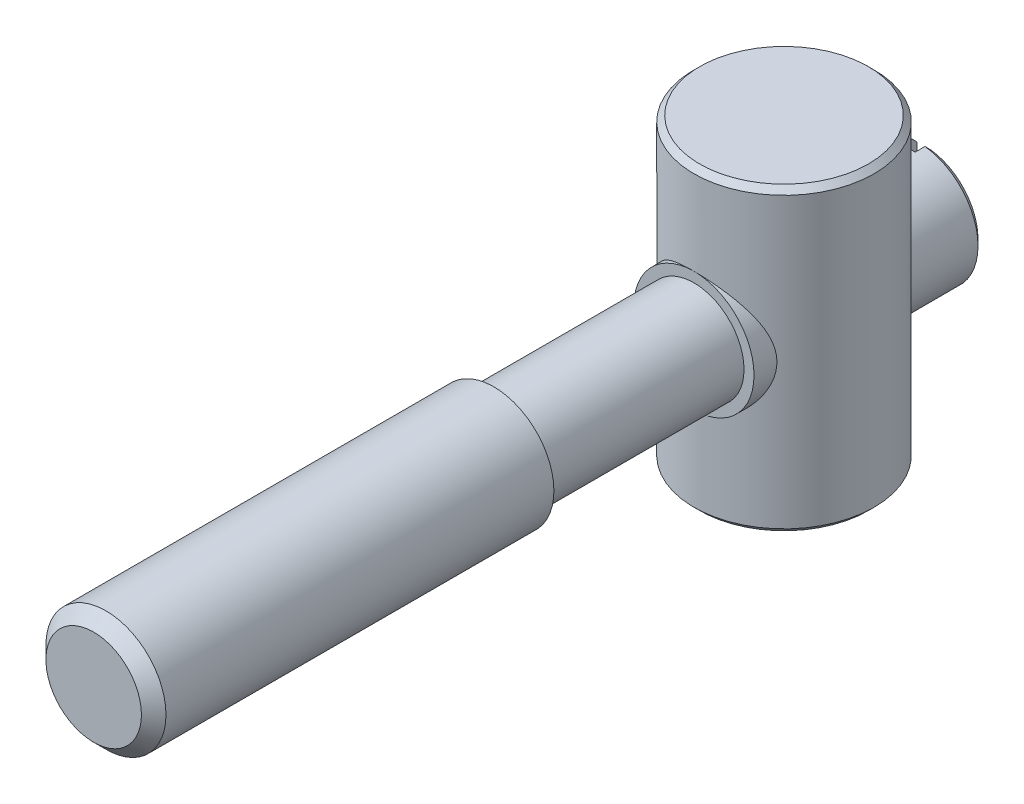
ISO-10303-21;
HEADER;
FILE_DESCRIPTION(('STEP AP214'),'2;1');
FILE_NAME('part.step','',(''),(''),'','','');
FILE_SCHEMA(('AUTOMOTIVE_DESIGN { 1 0 10303 214 1 1 1 1 }'));
ENDSEC;
DATA;
#1=APPLICATION_CONTEXT('core data for automotive mechanical design processes');
#2=APPLICATION_PROTOCOL_DEFINITION('international standard','automotive_design',2000,#1);
#3=PRODUCT_CONTEXT('',#1,'mechanical');
#4=PRODUCT('Part','Part','',(#3));
#5=PRODUCT_RELATED_PRODUCT_CATEGORY('part','',(#4));
#6=PRODUCT_DEFINITION_FORMATION('','',#4);
#7=PRODUCT_DEFINITION_CONTEXT('part definition',#1,'design');
#8=PRODUCT_DEFINITION('design','',#6,#7);
#9=PRODUCT_DEFINITION_SHAPE('','',#8);
#10=(LENGTH_UNIT() NAMED_UNIT(*) SI_UNIT(.MILLI.,.METRE.));
#11=(NAMED_UNIT(*) PLANE_ANGLE_UNIT() SI_UNIT($,.RADIAN.));
#12=(NAMED_UNIT(*) SI_UNIT($,.STERADIAN.) SOLID_ANGLE_UNIT());
#13=UNCERTAINTY_MEASURE_WITH_UNIT(LENGTH_MEASURE(1.E-05),#10,'distance_accuracy_value','');
#14=(GEOMETRIC_REPRESENTATION_CONTEXT(3) GLOBAL_UNCERTAINTY_ASSIGNED_CONTEXT((#13)) GLOBAL_UNIT_ASSIGNED_CONTEXT((#10,
#11,#12)) REPRESENTATION_CONTEXT('',''));
#15=CARTESIAN_POINT('',(0.,0.,0.));
#16=DIRECTION('',(0.,0.,1.));
#17=DIRECTION('',(1.,0.,0.));
#18=AXIS2_PLACEMENT_3D('',#15,#16,#17);
#19=CARTESIAN_POINT('',(2.3865,0.,19.8));
#20=DIRECTION('',(0.,0.,-1.));
#21=DIRECTION('',(-1.,0.,0.));
#22=AXIS2_PLACEMENT_3D('',#19,#20,#21);
#23=PLANE('',#22);
#24=CARTESIAN_POINT('',(0.,0.,19.8));
#25=DIRECTION('',(0.,0.,1.));
#26=DIRECTION('',(1.,0.,0.));
#27=AXIS2_PLACEMENT_3D('',#24,#25,#26);
#28=CIRCLE('',#27,2.3865);
#29=CARTESIAN_POINT('',(2.3865,0.,19.8));
#30=VERTEX_POINT('',#29);
#31=EDGE_CURVE('E439',#30,#30,#28,.T.);
#32=ORIENTED_EDGE('',*,*,#31,.T.);
#33=EDGE_LOOP('',(#32));
#34=FACE_BOUND('',#33,.T.);
#35=ADVANCED_FACE('F14',(#34),#23,.F.);
#36=CARTESIAN_POINT('',(0.,0.,19.1865));
#37=DIRECTION('',(0.,0.,-1.));
#38=DIRECTION('',(-1.,0.,0.));
#39=AXIS2_PLACEMENT_3D('',#36,#37,#38);
#40=CONICAL_SURFACE('',#39,3.,0.785398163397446);
#41=ORIENTED_EDGE('',*,*,#31,.F.);
#42=EDGE_LOOP('',(#41));
#43=FACE_BOUND('',#42,.T.);
#44=CARTESIAN_POINT('',(0.,0.,19.1865));
#45=DIRECTION('',(0.,0.,1.));
#46=DIRECTION('',(1.,0.,0.));
#47=AXIS2_PLACEMENT_3D('',#44,#45,#46);
#48=CIRCLE('',#47,3.);
#49=CARTESIAN_POINT('',(3.,0.,19.1865));
#50=VERTEX_POINT('',#49);
#51=EDGE_CURVE('E442',#50,#50,#48,.T.);
#52=ORIENTED_EDGE('',*,*,#51,.T.);
#53=EDGE_LOOP('',(#52));
#54=FACE_BOUND('',#53,.T.);
#55=ADVANCED_FACE('F882',(#43,#54),#40,.T.);
#56=CARTESIAN_POINT('',(0.,0.,19.8));
#57=DIRECTION('',(0.,0.,1.));
#58=DIRECTION('',(1.,0.,0.));
#59=AXIS2_PLACEMENT_3D('',#56,#57,#58);
#60=CYLINDRICAL_SURFACE('',#59,3.);
#61=ORIENTED_EDGE('',*,*,#51,.F.);
#62=EDGE_LOOP('',(#61));
#63=FACE_BOUND('',#62,.T.);
#64=CARTESIAN_POINT('',(0.,0.,-0.199999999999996));
#65=DIRECTION('',(0.,0.,1.));
#66=DIRECTION('',(1.,0.,0.));
#67=AXIS2_PLACEMENT_3D('',#64,#65,#66);
#68=CIRCLE('',#67,3.);
#69=CARTESIAN_POINT('',(3.,0.,-0.199999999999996));
#70=VERTEX_POINT('',#69);
#71=EDGE_CURVE('E445',#70,#70,#68,.T.);
#72=ORIENTED_EDGE('',*,*,#71,.T.);
#73=EDGE_LOOP('',(#72));
#74=FACE_BOUND('',#73,.T.);
#75=ADVANCED_FACE('F873',(#63,#74),#60,.T.);
#76=CARTESIAN_POINT('',(0.,0.,-0.199999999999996));
#77=DIRECTION('',(0.,0.,1.));
#78=DIRECTION('',(1.,0.,0.));
#79=AXIS2_PLACEMENT_3D('',#76,#77,#78);
#80=PLANE('',#79);
#81=ORIENTED_EDGE('',*,*,#71,.F.);
#82=EDGE_LOOP('',(#81));
#83=FACE_BOUND('',#82,.T.);
#84=CARTESIAN_POINT('',(0.,0.,-0.199999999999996));
#85=DIRECTION('',(0.,0.,1.));
#86=DIRECTION('',(1.,0.,0.));
#87=AXIS2_PLACEMENT_3D('',#84,#85,#86);
#88=CIRCLE('',#87,2.5);
#89=CARTESIAN_POINT('',(2.5,0.,-0.199999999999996));
#90=VERTEX_POINT('',#89);
#91=EDGE_CURVE('E448',#90,#90,#88,.T.);
#92=ORIENTED_EDGE('',*,*,#91,.T.);
#93=EDGE_LOOP('',(#92));
#94=FACE_BOUND('',#93,.T.);
#95=ADVANCED_FACE('F864',(#83,#94),#80,.F.);
#96=CARTESIAN_POINT('',(0.,0.,-0.199999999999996));
#97=DIRECTION('',(0.,0.,1.));
#98=DIRECTION('',(1.,0.,0.));
#99=AXIS2_PLACEMENT_3D('',#96,#97,#98);
#100=CYLINDRICAL_SURFACE('',#99,2.5);
#101=ORIENTED_EDGE('',*,*,#91,.F.);
#102=EDGE_LOOP('',(#101));
#103=FACE_BOUND('',#102,.T.);
#104=CARTESIAN_POINT('',(0.,0.,-10.2));
#105=DIRECTION('',(0.,0.,1.));
#106=DIRECTION('',(1.,0.,0.));
#107=AXIS2_PLACEMENT_3D('',#104,#105,#106);
#108=CIRCLE('',#107,2.5);
#109=CARTESIAN_POINT('',(2.5,0.,-10.2));
#110=VERTEX_POINT('',#109);
#111=EDGE_CURVE('E451',#110,#110,#108,.T.);
#112=ORIENTED_EDGE('',*,*,#111,.T.);
#113=EDGE_LOOP('',(#112));
#114=FACE_BOUND('',#113,.T.);
#115=ADVANCED_FACE('F856',(#103,#114),#100,.T.);
#116=CARTESIAN_POINT('',(0.,3.,-10.2));
#117=DIRECTION('',(0.,0.,-1.));
#118=DIRECTION('',(-1.,0.,0.));
#119=AXIS2_PLACEMENT_3D('',#116,#117,#118);
#120=PLANE('',#119);
#121=ORIENTED_EDGE('',*,*,#111,.F.);
#122=EDGE_LOOP('',(#121));
#123=FACE_BOUND('',#122,.T.);
#124=CARTESIAN_POINT('',(0.,0.,-10.2));
#125=DIRECTION('',(0.,0.,1.));
#126=DIRECTION('',(1.,0.,0.));
#127=AXIS2_PLACEMENT_3D('',#124,#125,#126);
#128=CIRCLE('',#127,3.);
#129=CARTESIAN_POINT('',(0.,3.,-10.2));
#130=VERTEX_POINT('',#129);
#131=CARTESIAN_POINT('',(0.,-3.,-10.2));
#132=VERTEX_POINT('',#131);
#133=EDGE_CURVE('E455',#130,#132,#128,.T.);
#134=ORIENTED_EDGE('',*,*,#133,.T.);
#135=EDGE_CURVE('E454',#132,#130,#128,.T.);
#136=ORIENTED_EDGE('',*,*,#135,.T.);
#137=EDGE_LOOP('',(#134,#136));
#138=FACE_BOUND('',#137,.T.);
#139=ADVANCED_FACE('F848',(#123,#138),#120,.F.);
#140=CARTESIAN_POINT('',(0.,0.,-10.2));
#141=DIRECTION('',(0.,0.,1.));
#142=DIRECTION('',(1.,0.,0.));
#143=AXIS2_PLACEMENT_3D('',#140,#141,#142);
#144=CYLINDRICAL_SURFACE('',#143,3.);
#145=CARTESIAN_POINT('',(3.,0.,-11.3458980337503));
#146=CARTESIAN_POINT('',(3.00000458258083,-0.0732569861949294,-11.3459058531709));
#147=CARTESIAN_POINT('',(2.99731244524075,-0.146481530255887,-11.3434885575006));
#148=CARTESIAN_POINT('',(2.98662615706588,-0.292242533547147,-11.3339762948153));
#149=CARTESIAN_POINT('',(2.97863116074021,-0.36477888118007,-11.3268805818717));
#150=CARTESIAN_POINT('',(2.94687150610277,-0.580557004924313,-11.2990027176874));
#151=CARTESIAN_POINT('',(2.91533243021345,-0.7218872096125,-11.2716303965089));
#152=CARTESIAN_POINT('',(2.83403844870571,-0.994135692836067,-11.2041558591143));
#153=CARTESIAN_POINT('',(2.78446038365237,-1.12514051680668,-11.1641777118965));
#154=CARTESIAN_POINT('',(2.66901051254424,-1.37678977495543,-11.0762374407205));
#155=CARTESIAN_POINT('',(2.60313532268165,-1.49743205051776,-11.0282736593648));
#156=CARTESIAN_POINT('',(2.44503375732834,-1.7454742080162,-10.9208087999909));
#157=CARTESIAN_POINT('',(2.35030173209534,-1.87100290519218,-10.8606739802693));
#158=CARTESIAN_POINT('',(2.14229810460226,-2.10599933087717,-10.7408295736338));
#159=CARTESIAN_POINT('',(2.02900845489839,-2.21545122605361,-10.6811204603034));
#160=CARTESIAN_POINT('',(1.76719317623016,-2.43098271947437,-10.5586587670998));
#161=CARTESIAN_POINT('',(1.61594159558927,-2.53429147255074,-10.4967124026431));
#162=CARTESIAN_POINT('',(1.37421346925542,-2.6683430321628,-10.4141112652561));
#163=CARTESIAN_POINT('',(1.29113866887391,-2.70954965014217,-10.3882918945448));
#164=CARTESIAN_POINT('',(1.12054013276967,-2.78442936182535,-10.3408485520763));
#165=CARTESIAN_POINT('',(1.03301977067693,-2.81810806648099,-10.3192214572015));
#166=CARTESIAN_POINT('',(0.864225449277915,-2.87404180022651,-10.2830195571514));
#167=CARTESIAN_POINT('',(0.78334499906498,-2.89715242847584,-10.2679269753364));
#168=CARTESIAN_POINT('',(0.619315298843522,-2.93658943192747,-10.2420480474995));
#169=CARTESIAN_POINT('',(0.536167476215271,-2.95291997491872,-10.2312590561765));
#170=CARTESIAN_POINT('',(0.368381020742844,-2.97850414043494,-10.2143123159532));
#171=CARTESIAN_POINT('',(0.283743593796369,-2.98776324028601,-10.2081509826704));
#172=CARTESIAN_POINT('',(0.113806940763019,-2.99905173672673,-10.2006336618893));
#173=CARTESIAN_POINT('',(0.0285078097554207,-3.00108215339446,-10.1992769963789));
#174=CARTESIAN_POINT('',(-0.201115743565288,-2.99672182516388,-10.2021880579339));
#175=CARTESIAN_POINT('',(-0.345332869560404,-2.98351119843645,-10.2110109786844));
#176=CARTESIAN_POINT('',(-0.628886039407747,-2.93686864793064,-10.2418723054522));
#177=CARTESIAN_POINT('',(-0.76822172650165,-2.90343524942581,-10.2639116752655));
#178=CARTESIAN_POINT('',(-1.03810942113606,-2.81820508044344,-10.319219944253));
#179=CARTESIAN_POINT('',(-1.16869392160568,-2.76648129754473,-10.352444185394));
#180=CARTESIAN_POINT('',(-1.41931574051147,-2.64666991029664,-10.4276830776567));
#181=CARTESIAN_POINT('',(-1.53935112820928,-2.57857931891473,-10.4696993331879));
#182=CARTESIAN_POINT('',(-1.78242579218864,-2.41803177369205,-10.5657292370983));
#183=CARTESIAN_POINT('',(-1.90378704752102,-2.32354868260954,-10.6205938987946));
#184=CARTESIAN_POINT('',(-2.12998228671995,-2.11815201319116,-10.7339909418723));
#185=CARTESIAN_POINT('',(-2.23479025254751,-2.00721309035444,-10.7925288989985));
#186=CARTESIAN_POINT('',(-2.44158347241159,-1.75205517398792,-10.9177493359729));
#187=CARTESIAN_POINT('',(-2.54060388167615,-1.60534337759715,-10.9842852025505));
#188=CARTESIAN_POINT('',(-2.71252313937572,-1.29373524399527,-11.1078658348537));
#189=CARTESIAN_POINT('',(-2.78546578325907,-1.12887000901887,-11.1649264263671));
#190=CARTESIAN_POINT('',(-2.88499086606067,-0.832921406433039,-11.2460569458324));
#191=CARTESIAN_POINT('',(-2.91886187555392,-0.705609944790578,-11.27489453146));
#192=CARTESIAN_POINT('',(-2.96969333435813,-0.445440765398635,-11.318864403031));
#193=CARTESIAN_POINT('',(-2.98668310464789,-0.312593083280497,-11.3340204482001));
#194=CARTESIAN_POINT('',(-3.0026910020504,-0.0443355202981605,-11.3482866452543));
#195=CARTESIAN_POINT('',(-3.0016309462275,0.091082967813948,-11.3473269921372));
#196=CARTESIAN_POINT('',(-2.98142444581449,0.359525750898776,-11.3293517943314));
#197=CARTESIAN_POINT('',(-2.96226334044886,0.492548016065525,-11.3123232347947));
#198=CARTESIAN_POINT('',(-2.90849716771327,0.746084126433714,-11.266080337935));
#199=CARTESIAN_POINT('',(-2.87469261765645,0.866891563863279,-11.2375021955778));
#200=CARTESIAN_POINT('',(-2.79334562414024,1.10118935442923,-11.1715506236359));
#201=CARTESIAN_POINT('',(-2.74579856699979,1.21467723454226,-11.1341742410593));
#202=CARTESIAN_POINT('',(-2.6274501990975,1.45530300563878,-11.0458277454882));
#203=CARTESIAN_POINT('',(-2.55390043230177,1.5806352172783,-10.9936337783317));
#204=CARTESIAN_POINT('',(-2.39029097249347,1.81862520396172,-10.8860622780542));
#205=CARTESIAN_POINT('',(-2.30021117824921,1.93126727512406,-10.8306809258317));
#206=CARTESIAN_POINT('',(-2.08314986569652,2.16594352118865,-10.7088648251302));
#207=CARTESIAN_POINT('',(-1.95240579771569,2.28465427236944,-10.642658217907));
#208=CARTESIAN_POINT('',(-1.6696492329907,2.49872502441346,-10.5183662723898));
#209=CARTESIAN_POINT('',(-1.51765571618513,2.59410565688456,-10.4602737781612));
#210=CARTESIAN_POINT('',(-1.226231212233,2.74183760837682,-10.3681376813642));
#211=CARTESIAN_POINT('',(-1.08999354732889,2.79893475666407,-10.3316181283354));
#212=CARTESIAN_POINT('',(-0.808135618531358,2.89291079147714,-10.2708193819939));
#213=CARTESIAN_POINT('',(-0.662523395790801,2.929806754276,-10.2465298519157));
#214=CARTESIAN_POINT('',(-0.365054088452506,2.98154544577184,-10.2123245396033));
#215=CARTESIAN_POINT('',(-0.213172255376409,2.99629001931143,-10.2024727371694));
#216=CARTESIAN_POINT('',(0.0912833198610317,3.00247177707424,-10.1983526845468));
#217=CARTESIAN_POINT('',(0.243856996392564,2.99391112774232,-10.2040829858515));
#218=CARTESIAN_POINT('',(0.533636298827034,2.95551076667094,-10.2295566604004));
#219=CARTESIAN_POINT('',(0.671152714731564,2.92726352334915,-10.2482508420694));
#220=CARTESIAN_POINT('',(0.939027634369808,2.8526429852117,-10.2969584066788));
#221=CARTESIAN_POINT('',(1.06938502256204,2.80626687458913,-10.3269735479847));
#222=CARTESIAN_POINT('',(1.32772094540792,2.69409194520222,-10.3981235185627));
#223=CARTESIAN_POINT('',(1.45512538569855,2.62732454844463,-10.4398012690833));
#224=CARTESIAN_POINT('',(1.6973289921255,2.47777402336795,-10.5303688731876));
#225=CARTESIAN_POINT('',(1.81212055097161,2.39498131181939,-10.5792630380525));
#226=CARTESIAN_POINT('',(2.04494134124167,2.20105668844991,-10.6891060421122));
#227=CARTESIAN_POINT('',(2.1606402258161,2.08751563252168,-10.7507413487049));
#228=CARTESIAN_POINT('',(2.37240030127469,1.84332951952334,-10.8741995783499));
#229=CARTESIAN_POINT('',(2.46844680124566,1.71267178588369,-10.9360226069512));
#230=CARTESIAN_POINT('',(2.63269891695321,1.44619919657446,-11.0492369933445));
#231=CARTESIAN_POINT('',(2.70247011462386,1.31153938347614,-11.1010644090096));
#232=CARTESIAN_POINT('',(2.82173662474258,1.0300712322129,-11.1937867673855));
#233=CARTESIAN_POINT('',(2.87127132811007,0.883287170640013,-11.2347028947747));
#234=CARTESIAN_POINT('',(2.93904512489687,0.613848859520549,-11.2921362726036));
#235=CARTESIAN_POINT('',(2.96178740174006,0.493057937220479,-11.3120514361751));
#236=CARTESIAN_POINT('',(2.99225476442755,0.248145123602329,-11.3389203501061));
#237=CARTESIAN_POINT('',(2.99999224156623,0.12402606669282,-11.345884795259));
#238=CARTESIAN_POINT('',(3.,0.,-11.3458980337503));
#239=B_SPLINE_CURVE_WITH_KNOTS('',3,(#145,#146,#147,#148,#149,#150,#151,#152,#153,#154,#155,
#156,#157,#158,#159,#160,#161,#162,#163,#164,#165,#166,#167,#168,#169,#170,#171,#172,#173,#174,
#175,#176,#177,#178,#179,#180,#181,#182,#183,#184,#185,#186,#187,#188,#189,#190,#191,#192,#193,
#194,#195,#196,#197,#198,#199,#200,#201,#202,#203,#204,#205,#206,#207,#208,#209,#210,#211,#212,
#213,#214,#215,#216,#217,#218,#219,#220,#221,#222,#223,#224,#225,#226,#227,#228,#229,#230,#231,
#232,#233,#234,#235,#236,#237,#238),.UNSPECIFIED.,.T.,.F.,(4,2,2,2,2,2,2,2,2,2,2,2,2,2,2,2,2,2,
2,2,2,2,2,2,2,2,2,2,2,2,2,2,2,2,2,2,2,2,2,2,2,2,2,2,2,2,4),(0.,0.219620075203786,
0.439275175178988,0.878823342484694,1.31417375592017,1.74961463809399,2.2528349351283,
2.75654755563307,3.33302024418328,3.62140722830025,3.90957854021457,4.16557735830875,
4.42141857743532,4.67706142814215,4.93266820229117,5.36561317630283,5.79858972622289,
6.22985763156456,6.6612043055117,7.14923304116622,7.63802137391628,8.20270070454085,
8.76642719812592,9.16941150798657,9.571694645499,9.97572071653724,10.3800743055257,
10.764666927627,11.1493888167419,11.6110086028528,12.0731935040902,12.636340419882,
13.1989875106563,13.653578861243,14.1077853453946,14.56399859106,15.0201694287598,
15.4431718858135,15.8662400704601,16.3137880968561,16.7616045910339,17.2798532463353,
17.7984879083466,18.2775320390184,18.755639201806,19.1277693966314,19.4995921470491),.UNSPECIFIED.);
#240=EDGE_CURVE('E493',#130,#132,#239,.T.);
#241=ORIENTED_EDGE('',*,*,#240,.F.);
#242=ORIENTED_EDGE('',*,*,#135,.F.);
#243=EDGE_LOOP('',(#241,#242));
#244=FACE_BOUND('',#243,.T.);
#245=ADVANCED_FACE('F835',(#244),#144,.T.);
#246=EDGE_CURVE('E27',#132,#130,#239,.T.);
#247=ORIENTED_EDGE('',*,*,#246,.F.);
#248=ORIENTED_EDGE('',*,*,#133,.F.);
#249=EDGE_LOOP('',(#247,#248));
#250=FACE_BOUND('',#249,.T.);
#251=ADVANCED_FACE('F833',(#250),#144,.T.);
#252=CARTESIAN_POINT('',(0.,0.,-21.3935));
#253=DIRECTION('',(0.,0.,1.));
#254=DIRECTION('',(1.,0.,0.));
#255=AXIS2_PLACEMENT_3D('',#252,#253,#254);
#256=CIRCLE('',#255,3.);
#257=CARTESIAN_POINT('',(-0.35,2.97951338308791,-21.3935));
#258=VERTEX_POINT('',#257);
#259=CARTESIAN_POINT('',(-0.35,-2.97951338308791,-21.3935));
#260=VERTEX_POINT('',#259);
#261=EDGE_CURVE('E461',#258,#260,#256,.T.);
#262=ORIENTED_EDGE('',*,*,#261,.T.);
#263=DIRECTION('',(0.,0.,1.));
#264=VECTOR('',#263,1.);
#265=CARTESIAN_POINT('',(-0.35,-2.97951338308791,-10.2));
#266=LINE('',#265,#264);
#267=CARTESIAN_POINT('',(-0.35,-2.97951338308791,-20.9));
#268=VERTEX_POINT('',#267);
#269=EDGE_CURVE('E290',#260,#268,#266,.T.);
#270=ORIENTED_EDGE('',*,*,#269,.T.);
#271=CARTESIAN_POINT('',(0.,0.,-20.9));
#272=DIRECTION('',(0.,0.,-1.));
#273=DIRECTION('',(-1.,0.,0.));
#274=AXIS2_PLACEMENT_3D('',#271,#272,#273);
#275=CIRCLE('',#274,3.);
#276=CARTESIAN_POINT('',(0.35,-2.97951338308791,-20.9));
#277=VERTEX_POINT('',#276);
#278=EDGE_CURVE('E284',#277,#268,#275,.T.);
#279=ORIENTED_EDGE('',*,*,#278,.F.);
#280=DIRECTION('',(0.,0.,1.));
#281=VECTOR('',#280,1.);
#282=CARTESIAN_POINT('',(0.35,-2.97951338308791,-10.2));
#283=LINE('',#282,#281);
#284=CARTESIAN_POINT('',(0.35,-2.97951338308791,-21.3935));
#285=VERTEX_POINT('',#284);
#286=EDGE_CURVE('E347',#285,#277,#283,.T.);
#287=ORIENTED_EDGE('',*,*,#286,.F.);
#288=CARTESIAN_POINT('',(0.35,2.97951338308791,-21.3935));
#289=VERTEX_POINT('',#288);
#290=EDGE_CURVE('E458',#285,#289,#256,.T.);
#291=ORIENTED_EDGE('',*,*,#290,.T.);
#292=DIRECTION('',(0.,0.,1.));
#293=VECTOR('',#292,1.);
#294=CARTESIAN_POINT('',(0.35,2.97951338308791,-10.2));
#295=LINE('',#294,#293);
#296=CARTESIAN_POINT('',(0.35,2.97951338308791,-20.9));
#297=VERTEX_POINT('',#296);
#298=EDGE_CURVE('E339',#297,#289,#295,.F.);
#299=ORIENTED_EDGE('',*,*,#298,.F.);
#300=CARTESIAN_POINT('',(-0.35,2.97951338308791,-20.9));
#301=VERTEX_POINT('',#300);
#302=EDGE_CURVE('E286',#301,#297,#275,.T.);
#303=ORIENTED_EDGE('',*,*,#302,.F.);
#304=DIRECTION('',(0.,0.,1.));
#305=VECTOR('',#304,1.);
#306=CARTESIAN_POINT('',(-0.35,2.97951338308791,-10.2));
#307=LINE('',#306,#305);
#308=EDGE_CURVE('E297',#301,#258,#307,.F.);
#309=ORIENTED_EDGE('',*,*,#308,.T.);
#310=EDGE_LOOP('',(#262,#270,#279,#287,#291,#299,#303,#309));
#311=FACE_BOUND('',#310,.T.);
#312=CARTESIAN_POINT('',(3.,0.,-18.0541019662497));
#313=CARTESIAN_POINT('',(3.00000458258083,0.07325698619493,-18.0540941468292));
#314=CARTESIAN_POINT('',(2.99731244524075,0.146481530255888,-18.0565114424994));
#315=CARTESIAN_POINT('',(2.98662615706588,0.29224253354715,-18.0660237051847));
#316=CARTESIAN_POINT('',(2.97863116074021,0.364778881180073,-18.0731194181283));
#317=CARTESIAN_POINT('',(2.94687150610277,0.580557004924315,-18.1009972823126));
#318=CARTESIAN_POINT('',(2.91533243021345,0.7218872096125,-18.1283696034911));
#319=CARTESIAN_POINT('',(2.83403844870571,0.994135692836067,-18.1958441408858));
#320=CARTESIAN_POINT('',(2.78446038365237,1.12514051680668,-18.2358222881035));
#321=CARTESIAN_POINT('',(2.66901051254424,1.37678977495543,-18.3237625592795));
#322=CARTESIAN_POINT('',(2.60313532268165,1.49743205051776,-18.3717263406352));
#323=CARTESIAN_POINT('',(2.44503375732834,1.7454742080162,-18.4791912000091));
#324=CARTESIAN_POINT('',(2.35030173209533,1.87100290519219,-18.5393260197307));
#325=CARTESIAN_POINT('',(2.14229810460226,2.10599933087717,-18.6591704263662));
#326=CARTESIAN_POINT('',(2.02900845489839,2.21545122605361,-18.7188795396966));
#327=CARTESIAN_POINT('',(1.76719317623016,2.43098271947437,-18.8413412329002));
#328=CARTESIAN_POINT('',(1.61594159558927,2.53429147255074,-18.9032875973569));
#329=CARTESIAN_POINT('',(1.37421346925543,2.6683430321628,-18.9858887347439));
#330=CARTESIAN_POINT('',(1.29113866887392,2.70954965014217,-19.0117081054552));
#331=CARTESIAN_POINT('',(1.12054013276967,2.78442936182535,-19.0591514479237));
#332=CARTESIAN_POINT('',(1.03301977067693,2.81810806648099,-19.0807785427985));
#333=CARTESIAN_POINT('',(0.864225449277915,2.87404180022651,-19.1169804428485));
#334=CARTESIAN_POINT('',(0.783344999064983,2.89715242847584,-19.1320730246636));
#335=CARTESIAN_POINT('',(0.619315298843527,2.93658943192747,-19.1579519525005));
#336=CARTESIAN_POINT('',(0.536167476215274,2.95291997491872,-19.1687409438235));
#337=CARTESIAN_POINT('',(0.368381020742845,2.97850414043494,-19.1856876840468));
#338=CARTESIAN_POINT('',(0.283743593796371,2.98776324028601,-19.1918490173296));
#339=CARTESIAN_POINT('',(0.11380694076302,2.99905173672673,-19.1993663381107));
#340=CARTESIAN_POINT('',(0.0285078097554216,3.00108215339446,-19.2007230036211));
#341=CARTESIAN_POINT('',(-0.201115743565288,2.99672182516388,-19.1978119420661));
#342=CARTESIAN_POINT('',(-0.345332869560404,2.98351119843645,-19.1889890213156));
#343=CARTESIAN_POINT('',(-0.628886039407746,2.93686864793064,-19.1581276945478));
#344=CARTESIAN_POINT('',(-0.768221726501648,2.90343524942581,-19.1360883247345));
#345=CARTESIAN_POINT('',(-1.03810942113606,2.81820508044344,-19.080780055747));
#346=CARTESIAN_POINT('',(-1.16869392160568,2.76648129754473,-19.047555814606));
#347=CARTESIAN_POINT('',(-1.41931574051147,2.64666991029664,-18.9723169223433));
#348=CARTESIAN_POINT('',(-1.53935112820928,2.57857931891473,-18.9303006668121));
#349=CARTESIAN_POINT('',(-1.78242579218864,2.41803177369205,-18.8342707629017));
#350=CARTESIAN_POINT('',(-1.90378704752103,2.32354868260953,-18.7794061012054));
#351=CARTESIAN_POINT('',(-2.12998228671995,2.11815201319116,-18.6660090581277));
#352=CARTESIAN_POINT('',(-2.23479025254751,2.00721309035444,-18.6074711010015));
#353=CARTESIAN_POINT('',(-2.44158347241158,1.75205517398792,-18.4822506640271));
#354=CARTESIAN_POINT('',(-2.54060388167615,1.60534337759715,-18.4157147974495));
#355=CARTESIAN_POINT('',(-2.71252313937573,1.29373524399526,-18.2921341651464));
#356=CARTESIAN_POINT('',(-2.78546578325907,1.12887000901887,-18.2350735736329));
#357=CARTESIAN_POINT('',(-2.88499086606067,0.832921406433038,-18.1539430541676));
#358=CARTESIAN_POINT('',(-2.91886187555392,0.705609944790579,-18.12510546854));
#359=CARTESIAN_POINT('',(-2.96969333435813,0.445440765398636,-18.081135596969));
#360=CARTESIAN_POINT('',(-2.98668310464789,0.312593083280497,-18.0659795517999));
#361=CARTESIAN_POINT('',(-3.0026910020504,0.0443355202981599,-18.0517133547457));
#362=CARTESIAN_POINT('',(-3.0016309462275,-0.0910829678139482,-18.0526730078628));
#363=CARTESIAN_POINT('',(-2.98142444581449,-0.359525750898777,-18.0706482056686));
#364=CARTESIAN_POINT('',(-2.96226334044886,-0.492548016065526,-18.0876767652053));
#365=CARTESIAN_POINT('',(-2.90849716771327,-0.746084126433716,-18.133919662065));
#366=CARTESIAN_POINT('',(-2.87469261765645,-0.86689156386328,-18.1624978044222));
#367=CARTESIAN_POINT('',(-2.79334562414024,-1.10118935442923,-18.2284493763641));
#368=CARTESIAN_POINT('',(-2.74579856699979,-1.21467723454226,-18.2658257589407));
#369=CARTESIAN_POINT('',(-2.6274501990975,-1.45530300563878,-18.3541722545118));
#370=CARTESIAN_POINT('',(-2.55390043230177,-1.5806352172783,-18.4063662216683));
#371=CARTESIAN_POINT('',(-2.39029097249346,-1.81862520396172,-18.5139377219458));
#372=CARTESIAN_POINT('',(-2.30021117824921,-1.93126727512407,-18.5693190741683));
#373=CARTESIAN_POINT('',(-2.08314986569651,-2.16594352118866,-18.6911351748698));
#374=CARTESIAN_POINT('',(-1.95240579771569,-2.28465427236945,-18.757341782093));
#375=CARTESIAN_POINT('',(-1.6696492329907,-2.49872502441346,-18.8816337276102));
#376=CARTESIAN_POINT('',(-1.51765571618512,-2.59410565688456,-18.9397262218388));
#377=CARTESIAN_POINT('',(-1.226231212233,-2.74183760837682,-19.0318623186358));
#378=CARTESIAN_POINT('',(-1.08999354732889,-2.79893475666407,-19.0683818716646));
#379=CARTESIAN_POINT('',(-0.808135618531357,-2.89291079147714,-19.1291806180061));
#380=CARTESIAN_POINT('',(-0.6625233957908,-2.929806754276,-19.1534701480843));
#381=CARTESIAN_POINT('',(-0.365054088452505,-2.98154544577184,-19.1876754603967));
#382=CARTESIAN_POINT('',(-0.213172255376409,-2.99629001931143,-19.1975272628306));
#383=CARTESIAN_POINT('',(0.0912833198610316,-3.00247177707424,-19.2016473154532));
#384=CARTESIAN_POINT('',(0.243856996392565,-2.99391112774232,-19.1959170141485));
#385=CARTESIAN_POINT('',(0.533636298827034,-2.95551076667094,-19.1704433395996));
#386=CARTESIAN_POINT('',(0.671152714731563,-2.92726352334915,-19.1517491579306));
#387=CARTESIAN_POINT('',(0.939027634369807,-2.8526429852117,-19.1030415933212));
#388=CARTESIAN_POINT('',(1.06938502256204,-2.80626687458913,-19.0730264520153));
#389=CARTESIAN_POINT('',(1.32772094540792,-2.69409194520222,-19.0018764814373));
#390=CARTESIAN_POINT('',(1.45512538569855,-2.62732454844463,-18.9601987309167));
#391=CARTESIAN_POINT('',(1.69732899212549,-2.47777402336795,-18.8696311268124));
#392=CARTESIAN_POINT('',(1.81212055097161,-2.39498131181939,-18.8207369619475));
#393=CARTESIAN_POINT('',(2.04494134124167,-2.20105668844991,-18.7108939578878));
#394=CARTESIAN_POINT('',(2.1606402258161,-2.08751563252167,-18.6492586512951));
#395=CARTESIAN_POINT('',(2.37240030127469,-1.84332951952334,-18.5258004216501));
#396=CARTESIAN_POINT('',(2.46844680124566,-1.71267178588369,-18.4639773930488));
#397=CARTESIAN_POINT('',(2.63269891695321,-1.44619919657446,-18.3507630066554));
#398=CARTESIAN_POINT('',(2.70247011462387,-1.31153938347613,-18.2989355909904));
#399=CARTESIAN_POINT('',(2.82173662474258,-1.03007123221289,-18.2062132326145));
#400=CARTESIAN_POINT('',(2.87127132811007,-0.883287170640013,-18.1652971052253));
#401=CARTESIAN_POINT('',(2.93904512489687,-0.613848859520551,-18.1078637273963));
#402=CARTESIAN_POINT('',(2.96178740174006,-0.493057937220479,-18.0879485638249));
#403=CARTESIAN_POINT('',(2.99225476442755,-0.248145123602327,-18.0610796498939));
#404=CARTESIAN_POINT('',(2.99999224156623,-0.12402606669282,-18.054115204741));
#405=CARTESIAN_POINT('',(3.,0.,-18.0541019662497));
#406=B_SPLINE_CURVE_WITH_KNOTS('',3,(#312,#313,#314,#315,#316,#317,#318,#319,#320,#321,#322,
#323,#324,#325,#326,#327,#328,#329,#330,#331,#332,#333,#334,#335,#336,#337,#338,#339,#340,#341,
#342,#343,#344,#345,#346,#347,#348,#349,#350,#351,#352,#353,#354,#355,#356,#357,#358,#359,#360,
#361,#362,#363,#364,#365,#366,#367,#368,#369,#370,#371,#372,#373,#374,#375,#376,#377,#378,#379,
#380,#381,#382,#383,#384,#385,#386,#387,#388,#389,#390,#391,#392,#393,#394,#395,#396,#397,#398,
#399,#400,#401,#402,#403,#404,#405),.UNSPECIFIED.,.T.,.F.,(4,2,2,2,2,2,2,2,2,2,2,2,2,2,2,2,2,2,
2,2,2,2,2,2,2,2,2,2,2,2,2,2,2,2,2,2,2,2,2,2,2,2,2,2,2,2,4),(0.,0.219620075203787,
0.439275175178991,0.878823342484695,1.31417375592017,1.74961463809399,2.2528349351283,
2.75654755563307,3.33302024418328,3.62140722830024,3.90957854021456,4.16557735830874,
4.42141857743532,4.67706142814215,4.93266820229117,5.36561317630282,5.79858972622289,
6.22985763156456,6.6612043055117,7.14923304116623,7.63802137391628,8.20270070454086,
8.76642719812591,9.16941150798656,9.571694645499,9.97572071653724,10.3800743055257,
10.764666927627,11.1493888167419,11.6110086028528,12.0731935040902,12.636340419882,
13.1989875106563,13.653578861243,14.1077853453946,14.56399859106,15.0201694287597,
15.4431718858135,15.8662400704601,16.3137880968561,16.7616045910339,17.2798532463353,
17.7984879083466,18.2775320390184,18.755639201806,19.1277693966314,19.4995921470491),.UNSPECIFIED.);
#407=CARTESIAN_POINT('',(3.,0.,-18.0541019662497));
#408=VERTEX_POINT('',#407);
#409=EDGE_CURVE('E9',#408,#408,#406,.T.);
#410=ORIENTED_EDGE('',*,*,#409,.F.);
#411=EDGE_LOOP('',(#410));
#412=FACE_BOUND('',#411,.T.);
#413=ADVANCED_FACE('F494',(#311,#412),#144,.T.);
#414=CARTESIAN_POINT('',(0.362499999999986,-1.5223709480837,-20.1));
#415=DIRECTION('',(0.,0.,-1.));
#416=DIRECTION('',(-1.,0.,0.));
#417=AXIS2_PLACEMENT_3D('',#414,#415,#416);
#418=PLANE('',#417);
#419=CARTESIAN_POINT('',(-1.54932383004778,-0.894502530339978,-20.1));
#420=DIRECTION('',(0.,0.,-1.));
#421=DIRECTION('',(0.,1.,0.));
#422=AXIS2_PLACEMENT_3D('',#419,#420,#421);
#423=CIRCLE('',#422,0.7);
#424=CARTESIAN_POINT('',(-0.900526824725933,-0.631705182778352,-20.1));
#425=VERTEX_POINT('',#424);
#426=CARTESIAN_POINT('',(-0.908183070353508,-1.17546253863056,-20.1));
#427=VERTEX_POINT('',#426);
#428=EDGE_CURVE('E273',#425,#427,#423,.T.);
#429=ORIENTED_EDGE('',*,*,#428,.F.);
#430=CARTESIAN_POINT('',(0.,0.,-20.1));
#431=DIRECTION('',(0.,0.,-1.));
#432=DIRECTION('',(-1.,0.,0.));
#433=AXIS2_PLACEMENT_3D('',#430,#431,#432);
#434=CIRCLE('',#433,1.10000000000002);
#435=CARTESIAN_POINT('',(-0.096809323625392,-1.09573169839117,-20.1));
#436=VERTEX_POINT('',#435);
#437=EDGE_CURVE('E478',#425,#436,#434,.F.);
#438=ORIENTED_EDGE('',*,*,#437,.T.);
#439=CARTESIAN_POINT('',(0.,-1.78900506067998,-20.1));
#440=DIRECTION('',(0.,0.,-1.));
#441=DIRECTION('',(0.,1.,0.));
#442=AXIS2_PLACEMENT_3D('',#439,#440,#441);
#443=CIRCLE('',#442,0.7);
#444=CARTESIAN_POINT('',(-0.563888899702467,-1.3742409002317,-20.1));
#445=VERTEX_POINT('',#444);
#446=EDGE_CURVE('E276',#445,#436,#443,.T.);
#447=ORIENTED_EDGE('',*,*,#446,.F.);
#448=CARTESIAN_POINT('',(-0.725000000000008,-1.25573683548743,-20.1));
#449=DIRECTION('',(0.,0.,-1.));
#450=DIRECTION('',(0.,1.,0.));
#451=AXIS2_PLACEMENT_3D('',#448,#449,#450);
#452=CIRCLE('',#451,0.2);
#453=EDGE_CURVE('E274',#445,#427,#452,.T.);
#454=ORIENTED_EDGE('',*,*,#453,.T.);
#455=EDGE_LOOP('',(#429,#438,#447,#454));
#456=FACE_BOUND('',#455,.T.);
#457=ADVANCED_FACE('F657',(#456),#418,.T.);
#458=CARTESIAN_POINT('',(0.0968093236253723,-1.09573169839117,-20.1));
#459=VERTEX_POINT('',#458);
#460=CARTESIAN_POINT('',(0.563888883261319,-1.37424087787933,-20.1));
#461=VERTEX_POINT('',#460);
#462=EDGE_CURVE('E280',#459,#461,#443,.T.);
#463=ORIENTED_EDGE('',*,*,#462,.F.);
#464=CARTESIAN_POINT('',(0.900526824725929,-0.631705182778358,-20.1));
#465=VERTEX_POINT('',#464);
#466=EDGE_CURVE('E950',#459,#465,#434,.F.);
#467=ORIENTED_EDGE('',*,*,#466,.T.);
#468=CARTESIAN_POINT('',(1.54932383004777,-0.894502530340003,-20.1));
#469=DIRECTION('',(0.,0.,-1.));
#470=DIRECTION('',(0.,1.,0.));
#471=AXIS2_PLACEMENT_3D('',#468,#469,#470);
#472=CIRCLE('',#471,0.7);
#473=CARTESIAN_POINT('',(0.908183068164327,-1.17546253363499,-20.1));
#474=VERTEX_POINT('',#473);
#475=EDGE_CURVE('E415',#474,#465,#472,.T.);
#476=ORIENTED_EDGE('',*,*,#475,.F.);
#477=CARTESIAN_POINT('',(0.724999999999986,-1.25573683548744,-20.1));
#478=DIRECTION('',(0.,0.,-1.));
#479=DIRECTION('',(0.,1.,0.));
#480=AXIS2_PLACEMENT_3D('',#477,#478,#479);
#481=CIRCLE('',#480,0.2);
#482=EDGE_CURVE('E281',#474,#461,#481,.T.);
#483=ORIENTED_EDGE('',*,*,#482,.T.);
#484=EDGE_LOOP('',(#463,#467,#476,#483));
#485=FACE_BOUND('',#484,.T.);
#486=ADVANCED_FACE('F811',(#485),#418,.T.);
#487=CARTESIAN_POINT('',(0.997336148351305,-0.464026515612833,-20.1));
#488=VERTEX_POINT('',#487);
#489=CARTESIAN_POINT('',(1.47207195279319,-0.198778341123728,-20.1));
#490=VERTEX_POINT('',#489);
#491=EDGE_CURVE('E964',#488,#490,#472,.T.);
#492=ORIENTED_EDGE('',*,*,#491,.F.);
#493=CARTESIAN_POINT('',(0.997336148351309,0.464026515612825,-20.1));
#494=VERTEX_POINT('',#493);
#495=EDGE_CURVE('E246',#488,#494,#434,.F.);
#496=ORIENTED_EDGE('',*,*,#495,.T.);
#497=CARTESIAN_POINT('',(1.54932383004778,0.894502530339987,-20.1));
#498=DIRECTION('',(0.,0.,-1.));
#499=DIRECTION('',(0.,1.,0.));
#500=AXIS2_PLACEMENT_3D('',#497,#498,#499);
#501=CIRCLE('',#500,0.7);
#502=CARTESIAN_POINT('',(1.47207196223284,0.198778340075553,-20.1));
#503=VERTEX_POINT('',#502);
#504=EDGE_CURVE('E961',#503,#494,#501,.T.);
#505=ORIENTED_EDGE('',*,*,#504,.F.);
#506=CARTESIAN_POINT('',(1.45,0.,-20.1));
#507=DIRECTION('',(0.,0.,-1.));
#508=DIRECTION('',(0.,1.,0.));
#509=AXIS2_PLACEMENT_3D('',#506,#507,#508);
#510=CIRCLE('',#509,0.2);
#511=EDGE_CURVE('E970',#503,#490,#510,.T.);
#512=ORIENTED_EDGE('',*,*,#511,.T.);
#513=EDGE_LOOP('',(#492,#496,#505,#512));
#514=FACE_BOUND('',#513,.T.);
#515=ADVANCED_FACE('F804',(#514),#418,.T.);
#516=CARTESIAN_POINT('',(0.900526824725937,0.631705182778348,-20.1));
#517=VERTEX_POINT('',#516);
#518=CARTESIAN_POINT('',(0.908183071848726,1.17546254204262,-20.1));
#519=VERTEX_POINT('',#518);
#520=EDGE_CURVE('E244',#517,#519,#501,.T.);
#521=ORIENTED_EDGE('',*,*,#520,.F.);
#522=CARTESIAN_POINT('',(0.0968093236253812,1.09573169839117,-20.1));
#523=VERTEX_POINT('',#522);
#524=EDGE_CURVE('E219',#517,#523,#434,.F.);
#525=ORIENTED_EDGE('',*,*,#524,.T.);
#526=CARTESIAN_POINT('',(0.,1.78900506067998,-20.1));
#527=DIRECTION('',(0.,0.,-1.));
#528=DIRECTION('',(0.,1.,0.));
#529=AXIS2_PLACEMENT_3D('',#526,#527,#528);
#530=CIRCLE('',#529,0.7);
#531=CARTESIAN_POINT('',(0.563888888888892,1.37424088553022,-20.1));
#532=VERTEX_POINT('',#531);
#533=EDGE_CURVE('E235',#532,#523,#530,.T.);
#534=ORIENTED_EDGE('',*,*,#533,.F.);
#535=CARTESIAN_POINT('',(0.725,1.25573683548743,-20.1));
#536=DIRECTION('',(0.,0.,-1.));
#537=DIRECTION('',(0.,1.,0.));
#538=AXIS2_PLACEMENT_3D('',#535,#536,#537);
#539=CIRCLE('',#538,0.2);
#540=EDGE_CURVE('E252',#532,#519,#539,.T.);
#541=ORIENTED_EDGE('',*,*,#540,.T.);
#542=EDGE_LOOP('',(#521,#525,#534,#541));
#543=FACE_BOUND('',#542,.T.);
#544=ADVANCED_FACE('F241',(#543),#418,.T.);
#545=CARTESIAN_POINT('',(-0.0968093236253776,1.09573169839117,-20.1));
#546=VERTEX_POINT('',#545);
#547=CARTESIAN_POINT('',(-0.563888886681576,1.37424088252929,-20.1));
#548=VERTEX_POINT('',#547);
#549=EDGE_CURVE('E236',#546,#548,#530,.T.);
#550=ORIENTED_EDGE('',*,*,#549,.F.);
#551=CARTESIAN_POINT('',(-0.900526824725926,0.631705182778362,-20.1));
#552=VERTEX_POINT('',#551);
#553=EDGE_CURVE('E223',#546,#552,#434,.F.);
#554=ORIENTED_EDGE('',*,*,#553,.T.);
#555=CARTESIAN_POINT('',(-1.54932383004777,0.894502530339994,-20.1));
#556=DIRECTION('',(0.,0.,-1.));
#557=DIRECTION('',(0.,1.,0.));
#558=AXIS2_PLACEMENT_3D('',#555,#556,#557);
#559=CIRCLE('',#558,0.7);
#560=CARTESIAN_POINT('',(-0.908183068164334,1.17546253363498,-20.1));
#561=VERTEX_POINT('',#560);
#562=EDGE_CURVE('E258',#561,#552,#559,.T.);
#563=ORIENTED_EDGE('',*,*,#562,.F.);
#564=CARTESIAN_POINT('',(-0.725,1.25573683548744,-20.1));
#565=DIRECTION('',(0.,0.,-1.));
#566=DIRECTION('',(0.,1.,0.));
#567=AXIS2_PLACEMENT_3D('',#564,#565,#566);
#568=CIRCLE('',#567,0.2);
#569=EDGE_CURVE('E255',#561,#548,#568,.T.);
#570=ORIENTED_EDGE('',*,*,#569,.T.);
#571=EDGE_LOOP('',(#550,#554,#563,#570));
#572=FACE_BOUND('',#571,.T.);
#573=ADVANCED_FACE('F658',(#572),#418,.T.);
#574=CARTESIAN_POINT('',(0.,0.,-21.7));
#575=DIRECTION('',(0.,0.,1.));
#576=DIRECTION('',(1.,0.,0.));
#577=AXIS2_PLACEMENT_3D('',#574,#575,#576);
#578=PLANE('',#577);
#579=DIRECTION('',(0.,-1.,0.));
#580=VECTOR('',#579,1.);
#581=CARTESIAN_POINT('',(0.35,0.,-21.7));
#582=LINE('',#581,#580);
#583=CARTESIAN_POINT('',(0.35,2.67066326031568,-21.7));
#584=VERTEX_POINT('',#583);
#585=CARTESIAN_POINT('',(0.35,1.18278727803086,-21.7));
#586=VERTEX_POINT('',#585);
#587=EDGE_CURVE('E340',#584,#586,#582,.T.);
#588=ORIENTED_EDGE('',*,*,#587,.F.);
#589=CARTESIAN_POINT('',(0.,0.,-21.7));
#590=DIRECTION('',(0.,0.,1.));
#591=DIRECTION('',(1.,0.,0.));
#592=AXIS2_PLACEMENT_3D('',#589,#590,#591);
#593=CIRCLE('',#592,2.6935);
#594=CARTESIAN_POINT('',(0.35,-2.67066326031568,-21.7));
#595=VERTEX_POINT('',#594);
#596=EDGE_CURVE('E462',#595,#584,#593,.T.);
#597=ORIENTED_EDGE('',*,*,#596,.F.);
#598=CARTESIAN_POINT('',(0.35,-1.18278727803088,-21.7));
#599=VERTEX_POINT('',#598);
#600=EDGE_CURVE('E346',#599,#595,#582,.T.);
#601=ORIENTED_EDGE('',*,*,#600,.F.);
#602=CARTESIAN_POINT('',(0.,-1.78900506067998,-21.7));
#603=DIRECTION('',(0.,0.,-1.));
#604=DIRECTION('',(0.,1.,0.));
#605=AXIS2_PLACEMENT_3D('',#602,#603,#604);
#606=CIRCLE('',#605,0.7);
#607=CARTESIAN_POINT('',(0.563888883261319,-1.37424087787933,-21.7));
#608=VERTEX_POINT('',#607);
#609=EDGE_CURVE('E375',#599,#608,#606,.T.);
#610=ORIENTED_EDGE('',*,*,#609,.T.);
#611=CARTESIAN_POINT('',(0.724999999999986,-1.25573683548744,-21.7));
#612=DIRECTION('',(0.,0.,-1.));
#613=DIRECTION('',(0.,1.,0.));
#614=AXIS2_PLACEMENT_3D('',#611,#612,#613);
#615=CIRCLE('',#614,0.2);
#616=CARTESIAN_POINT('',(0.908183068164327,-1.17546253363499,-21.7));
#617=VERTEX_POINT('',#616);
#618=EDGE_CURVE('E382',#617,#608,#615,.T.);
#619=ORIENTED_EDGE('',*,*,#618,.F.);
#620=CARTESIAN_POINT('',(1.54932383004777,-0.894502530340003,-21.7));
#621=DIRECTION('',(0.,0.,-1.));
#622=DIRECTION('',(0.,1.,0.));
#623=AXIS2_PLACEMENT_3D('',#620,#621,#622);
#624=CIRCLE('',#623,0.7);
#625=CARTESIAN_POINT('',(1.47207195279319,-0.198778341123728,-21.7));
#626=VERTEX_POINT('',#625);
#627=EDGE_CURVE('E283',#617,#626,#624,.T.);
#628=ORIENTED_EDGE('',*,*,#627,.T.);
#629=CARTESIAN_POINT('',(1.45,0.,-21.7));
#630=DIRECTION('',(0.,0.,-1.));
#631=DIRECTION('',(0.,1.,0.));
#632=AXIS2_PLACEMENT_3D('',#629,#630,#631);
#633=CIRCLE('',#632,0.2);
#634=CARTESIAN_POINT('',(1.47207196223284,0.198778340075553,-21.7));
#635=VERTEX_POINT('',#634);
#636=EDGE_CURVE('E408',#635,#626,#633,.T.);
#637=ORIENTED_EDGE('',*,*,#636,.F.);
#638=CARTESIAN_POINT('',(1.54932383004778,0.894502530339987,-21.7));
#639=DIRECTION('',(0.,0.,-1.));
#640=DIRECTION('',(0.,1.,0.));
#641=AXIS2_PLACEMENT_3D('',#638,#639,#640);
#642=CIRCLE('',#641,0.7);
#643=CARTESIAN_POINT('',(0.908183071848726,1.17546254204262,-21.7));
#644=VERTEX_POINT('',#643);
#645=EDGE_CURVE('E405',#635,#644,#642,.T.);
#646=ORIENTED_EDGE('',*,*,#645,.T.);
#647=CARTESIAN_POINT('',(0.725,1.25573683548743,-21.7));
#648=DIRECTION('',(0.,0.,-1.));
#649=DIRECTION('',(0.,1.,0.));
#650=AXIS2_PLACEMENT_3D('',#647,#648,#649);
#651=CIRCLE('',#650,0.2);
#652=CARTESIAN_POINT('',(0.563888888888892,1.37424088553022,-21.7));
#653=VERTEX_POINT('',#652);
#654=EDGE_CURVE('E403',#653,#644,#651,.T.);
#655=ORIENTED_EDGE('',*,*,#654,.F.);
#656=CARTESIAN_POINT('',(0.,1.78900506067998,-21.7));
#657=DIRECTION('',(0.,0.,-1.));
#658=DIRECTION('',(0.,1.,0.));
#659=AXIS2_PLACEMENT_3D('',#656,#657,#658);
#660=CIRCLE('',#659,0.7);
#661=EDGE_CURVE('E400',#653,#586,#660,.T.);
#662=ORIENTED_EDGE('',*,*,#661,.T.);
#663=EDGE_LOOP('',(#588,#597,#601,#610,#619,#628,#637,#646,#655,#662));
#664=FACE_BOUND('',#663,.T.);
#665=ADVANCED_FACE('F778',(#664),#578,.F.);
#666=CARTESIAN_POINT('',(0.,0.,-21.7));
#667=DIRECTION('',(0.,0.,1.));
#668=DIRECTION('',(1.,0.,0.));
#669=AXIS2_PLACEMENT_3D('',#666,#667,#668);
#670=CONICAL_SURFACE('',#669,2.6935,0.785398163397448);
#671=CARTESIAN_POINT('',(0.35,2.98021819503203,-21.3928));
#672=CARTESIAN_POINT('',(0.35,2.90084818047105,-21.4716266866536));
#673=CARTESIAN_POINT('',(0.35,2.82145826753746,-21.5504333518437));
#674=CARTESIAN_POINT('',(0.35,2.66260716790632,-21.7080068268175));
#675=CARTESIAN_POINT('',(0.35,2.58314597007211,-21.7867736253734));
#676=CARTESIAN_POINT('',(0.35,2.42382350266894,-21.9445618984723));
#677=CARTESIAN_POINT('',(0.35,2.34396193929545,-22.0235830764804));
#678=CARTESIAN_POINT('',(0.35,2.18415716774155,-22.1815109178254));
#679=CARTESIAN_POINT('',(0.35,2.10421397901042,-22.2604176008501));
#680=CARTESIAN_POINT('',(0.35,1.89506425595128,-22.466515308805));
#681=CARTESIAN_POINT('',(0.35,1.76575322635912,-22.5936005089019));
#682=CARTESIAN_POINT('',(0.35,1.57125915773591,-22.7837869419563));
#683=CARTESIAN_POINT('',(0.35,1.50631532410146,-22.8471326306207));
#684=CARTESIAN_POINT('',(0.35,1.37619797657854,-22.9735762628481));
#685=CARTESIAN_POINT('',(0.35,1.31102448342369,-23.0366742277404));
#686=CARTESIAN_POINT('',(0.35,1.18058541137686,-23.1622531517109));
#687=CARTESIAN_POINT('',(0.35,1.1153212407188,-23.2247355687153));
#688=CARTESIAN_POINT('',(0.35,0.984202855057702,-23.3491215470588));
#689=CARTESIAN_POINT('',(0.35,0.918348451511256,-23.4110249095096));
#690=CARTESIAN_POINT('',(0.35,0.785758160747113,-23.5336994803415));
#691=CARTESIAN_POINT('',(0.35,0.719023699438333,-23.5944722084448));
#692=CARTESIAN_POINT('',(0.35,0.617447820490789,-23.6839263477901));
#693=CARTESIAN_POINT('',(0.35,0.583352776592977,-23.713452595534));
#694=CARTESIAN_POINT('',(0.35,0.514402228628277,-23.7716003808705));
#695=CARTESIAN_POINT('',(0.35,0.479546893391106,-23.8002221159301));
#696=CARTESIAN_POINT('',(0.35,0.430866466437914,-23.838449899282));
#697=CARTESIAN_POINT('',(0.35,0.417565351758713,-23.8487213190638));
#698=CARTESIAN_POINT('',(0.35,0.390754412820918,-23.8689888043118));
#699=CARTESIAN_POINT('',(0.35,0.377244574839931,-23.8789848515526));
#700=CARTESIAN_POINT('',(0.35,0.336268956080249,-23.9085114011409));
#701=CARTESIAN_POINT('',(0.35,0.308422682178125,-23.9275278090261));
#702=CARTESIAN_POINT('',(0.35,0.252243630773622,-23.9626185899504));
#703=CARTESIAN_POINT('',(0.35,0.223961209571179,-23.9787721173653));
#704=CARTESIAN_POINT('',(0.35,0.165534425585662,-24.0071618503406));
#705=CARTESIAN_POINT('',(0.35,0.135400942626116,-24.0194187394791));
#706=CARTESIAN_POINT('',(0.35,0.084061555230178,-24.034062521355));
#707=CARTESIAN_POINT('',(0.35,0.0634378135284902,-24.0384040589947));
#708=CARTESIAN_POINT('',(0.35,0.0217954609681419,-24.0434259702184));
#709=CARTESIAN_POINT('',(0.35,0.000778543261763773,-24.0441194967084));
#710=CARTESIAN_POINT('',(0.35,-0.0410025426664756,-24.0417257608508));
#711=CARTESIAN_POINT('',(0.35,-0.0617669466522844,-24.0386423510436));
#712=CARTESIAN_POINT('',(0.35,-0.102631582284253,-24.0293118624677));
#713=CARTESIAN_POINT('',(0.35,-0.122728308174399,-24.0230502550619));
#714=CARTESIAN_POINT('',(0.35,-0.167534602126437,-24.0061731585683));
#715=CARTESIAN_POINT('',(0.35,-0.191960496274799,-23.9948295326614));
#716=CARTESIAN_POINT('',(0.35,-0.239614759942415,-23.9698218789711));
#717=CARTESIAN_POINT('',(0.35,-0.262840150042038,-23.9561524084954));
#718=CARTESIAN_POINT('',(0.35,-0.308531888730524,-23.9272625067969));
#719=CARTESIAN_POINT('',(0.35,-0.330991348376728,-23.9120313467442));
#720=CARTESIAN_POINT('',(0.35,-0.375198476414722,-23.8806326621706));
#721=CARTESIAN_POINT('',(0.35,-0.396946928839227,-23.8644662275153));
#722=CARTESIAN_POINT('',(0.35,-0.442556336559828,-23.8294816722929));
#723=CARTESIAN_POINT('',(0.35,-0.466352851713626,-23.8105800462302));
#724=CARTESIAN_POINT('',(0.35,-0.513493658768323,-23.7722193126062));
#725=CARTESIAN_POINT('',(0.35,-0.536837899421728,-23.7527601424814));
#726=CARTESIAN_POINT('',(0.35,-0.606392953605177,-23.6937853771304));
#727=CARTESIAN_POINT('',(0.35,-0.652108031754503,-23.6536868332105));
#728=CARTESIAN_POINT('',(0.35,-0.742841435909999,-23.572581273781));
#729=CARTESIAN_POINT('',(0.35,-0.78785859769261,-23.5315729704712));
#730=CARTESIAN_POINT('',(0.35,-0.877391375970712,-23.4490335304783));
#731=CARTESIAN_POINT('',(0.35,-0.92190710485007,-23.4075025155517));
#732=CARTESIAN_POINT('',(0.35,-1.05457153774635,-23.2827786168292));
#733=CARTESIAN_POINT('',(0.35,-1.1422458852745,-23.1990825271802));
#734=CARTESIAN_POINT('',(0.35,-1.31688858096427,-23.0310947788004));
#735=CARTESIAN_POINT('',(0.35,-1.403857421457,-22.9468036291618));
#736=CARTESIAN_POINT('',(0.35,-1.61539609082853,-22.7408724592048));
#737=CARTESIAN_POINT('',(0.35,-1.7397674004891,-22.6190285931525));
#738=CARTESIAN_POINT('',(0.35,-1.98815063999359,-22.3749023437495));
#739=CARTESIAN_POINT('',(0.35,-2.11216245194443,-22.2526198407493));
#740=CARTESIAN_POINT('',(0.35,-2.36028699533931,-22.0074823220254));
#741=CARTESIAN_POINT('',(0.35,-2.48439908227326,-21.8846266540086));
#742=CARTESIAN_POINT('',(0.35,-2.73242659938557,-21.6387937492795));
#743=CARTESIAN_POINT('',(0.35,-2.85634207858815,-21.5158165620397));
#744=CARTESIAN_POINT('',(0.35,-2.98021819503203,-21.3928));
#745=B_SPLINE_CURVE_WITH_KNOTS('',3,(#671,#672,#673,#674,#675,#676,#677,#678,#679,#680,#681,
#682,#683,#684,#685,#686,#687,#688,#689,#690,#691,#692,#693,#694,#695,#696,#697,#698,#699,#700,
#701,#702,#703,#704,#705,#706,#707,#708,#709,#710,#711,#712,#713,#714,#715,#716,#717,#718,#719,
#720,#721,#722,#723,#724,#725,#726,#727,#728,#729,#730,#731,#732,#733,#734,#735,#736,#737,#738,
#739,#740,#741,#742,#743,#744),.UNSPECIFIED.,.F.,.F.,(4,2,2,2,2,2,2,2,2,2,2,2,2,2,2,2,2,2,2,2,2,
2,2,2,2,2,2,2,2,2,2,2,2,2,2,2,4),(0.,0.335587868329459,0.671243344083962,1.00828916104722,
1.34526778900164,1.88918530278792,2.1613491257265,2.43348897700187,2.7045415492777,
2.9756840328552,3.24643101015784,3.38173242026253,3.51700408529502,3.56741691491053,
3.61783307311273,3.71891729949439,3.81649619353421,3.91354813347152,3.97650892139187,
4.03924254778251,4.10191223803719,4.16487102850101,4.24545530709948,4.32623082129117,
4.40760408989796,4.48888437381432,4.58004157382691,4.67120904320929,4.85361307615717,
5.03629426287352,5.21893365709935,5.58255469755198,5.94589530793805,6.46822170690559,
6.99070346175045,7.51460775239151,8.03834968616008),.UNSPECIFIED.);
#746=EDGE_CURVE('E332',#289,#584,#745,.T.);
#747=ORIENTED_EDGE('',*,*,#746,.F.);
#748=ORIENTED_EDGE('',*,*,#290,.F.);
#749=EDGE_CURVE('E341',#595,#285,#745,.T.);
#750=ORIENTED_EDGE('',*,*,#749,.F.);
#751=ORIENTED_EDGE('',*,*,#596,.T.);
#752=EDGE_LOOP('',(#747,#748,#750,#751));
#753=FACE_BOUND('',#752,.T.);
#754=ADVANCED_FACE('F770',(#753),#670,.T.);
#755=CARTESIAN_POINT('',(-0.35,2.67066326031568,-21.7));
#756=VERTEX_POINT('',#755);
#757=CARTESIAN_POINT('',(-0.35,-2.67066326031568,-21.7));
#758=VERTEX_POINT('',#757);
#759=EDGE_CURVE('E465',#756,#758,#593,.T.);
#760=ORIENTED_EDGE('',*,*,#759,.F.);
#761=DIRECTION('',(0.,-1.,0.));
#762=VECTOR('',#761,1.);
#763=CARTESIAN_POINT('',(-0.35,0.,-21.7));
#764=LINE('',#763,#762);
#765=CARTESIAN_POINT('',(-0.35,1.18278727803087,-21.7));
#766=VERTEX_POINT('',#765);
#767=EDGE_CURVE('E309',#756,#766,#764,.T.);
#768=ORIENTED_EDGE('',*,*,#767,.T.);
#769=CARTESIAN_POINT('',(0.,1.78900506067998,-21.7));
#770=DIRECTION('',(0.,0.,1.));
#771=DIRECTION('',(1.,0.,0.));
#772=AXIS2_PLACEMENT_3D('',#769,#770,#771);
#773=CIRCLE('',#772,0.7);
#774=CARTESIAN_POINT('',(-0.563888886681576,1.37424088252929,-21.7));
#775=VERTEX_POINT('',#774);
#776=EDGE_CURVE('E466',#775,#766,#773,.T.);
#777=ORIENTED_EDGE('',*,*,#776,.F.);
#778=CARTESIAN_POINT('',(-0.725,1.25573683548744,-21.7));
#779=DIRECTION('',(0.,0.,-1.));
#780=DIRECTION('',(0.,1.,0.));
#781=AXIS2_PLACEMENT_3D('',#778,#779,#780);
#782=CIRCLE('',#781,0.2);
#783=CARTESIAN_POINT('',(-0.908183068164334,1.17546253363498,-21.7));
#784=VERTEX_POINT('',#783);
#785=EDGE_CURVE('E398',#784,#775,#782,.T.);
#786=ORIENTED_EDGE('',*,*,#785,.F.);
#787=CARTESIAN_POINT('',(-1.54932383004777,0.894502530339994,-21.7));
#788=DIRECTION('',(0.,0.,-1.));
#789=DIRECTION('',(0.,1.,0.));
#790=AXIS2_PLACEMENT_3D('',#787,#788,#789);
#791=CIRCLE('',#790,0.7);
#792=CARTESIAN_POINT('',(-1.4720719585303,0.198778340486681,-21.7));
#793=VERTEX_POINT('',#792);
#794=EDGE_CURVE('E395',#784,#793,#791,.T.);
#795=ORIENTED_EDGE('',*,*,#794,.T.);
#796=CARTESIAN_POINT('',(-1.45,0.,-21.7));
#797=DIRECTION('',(0.,0.,-1.));
#798=DIRECTION('',(0.,1.,0.));
#799=AXIS2_PLACEMENT_3D('',#796,#797,#798);
#800=CIRCLE('',#799,0.2);
#801=CARTESIAN_POINT('',(-1.4720719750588,-0.198778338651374,-21.7));
#802=VERTEX_POINT('',#801);
#803=EDGE_CURVE('E393',#802,#793,#800,.T.);
#804=ORIENTED_EDGE('',*,*,#803,.F.);
#805=CARTESIAN_POINT('',(-1.54932383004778,-0.894502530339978,-21.7));
#806=DIRECTION('',(0.,0.,-1.));
#807=DIRECTION('',(0.,1.,0.));
#808=AXIS2_PLACEMENT_3D('',#805,#806,#807);
#809=CIRCLE('',#808,0.7);
#810=CARTESIAN_POINT('',(-0.908183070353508,-1.17546253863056,-21.7));
#811=VERTEX_POINT('',#810);
#812=EDGE_CURVE('E390',#802,#811,#809,.T.);
#813=ORIENTED_EDGE('',*,*,#812,.T.);
#814=CARTESIAN_POINT('',(-0.725000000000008,-1.25573683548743,-21.7));
#815=DIRECTION('',(0.,0.,-1.));
#816=DIRECTION('',(0.,1.,0.));
#817=AXIS2_PLACEMENT_3D('',#814,#815,#816);
#818=CIRCLE('',#817,0.2);
#819=CARTESIAN_POINT('',(-0.563888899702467,-1.3742409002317,-21.7));
#820=VERTEX_POINT('',#819);
#821=EDGE_CURVE('E385',#820,#811,#818,.T.);
#822=ORIENTED_EDGE('',*,*,#821,.F.);
#823=CARTESIAN_POINT('',(-0.35,-1.18278727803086,-21.7));
#824=VERTEX_POINT('',#823);
#825=EDGE_CURVE('E381',#820,#824,#606,.T.);
#826=ORIENTED_EDGE('',*,*,#825,.T.);
#827=EDGE_CURVE('E296',#824,#758,#764,.T.);
#828=ORIENTED_EDGE('',*,*,#827,.T.);
#829=EDGE_LOOP('',(#760,#768,#777,#786,#795,#804,#813,#822,#826,#828));
#830=FACE_BOUND('',#829,.T.);
#831=ADVANCED_FACE('F768',(#830),#578,.F.);
#832=ORIENTED_EDGE('',*,*,#261,.F.);
#833=CARTESIAN_POINT('',(-0.35,2.98021819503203,-21.3928));
#834=CARTESIAN_POINT('',(-0.35,2.90084818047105,-21.4716266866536));
#835=CARTESIAN_POINT('',(-0.35,2.82145826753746,-21.5504333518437));
#836=CARTESIAN_POINT('',(-0.35,2.66260716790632,-21.7080068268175));
#837=CARTESIAN_POINT('',(-0.35,2.58314597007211,-21.7867736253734));
#838=CARTESIAN_POINT('',(-0.35,2.42382350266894,-21.9445618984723));
#839=CARTESIAN_POINT('',(-0.35,2.34396193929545,-22.0235830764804));
#840=CARTESIAN_POINT('',(-0.35,2.18415716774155,-22.1815109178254));
#841=CARTESIAN_POINT('',(-0.35,2.10421397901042,-22.2604176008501));
#842=CARTESIAN_POINT('',(-0.35,1.89506425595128,-22.466515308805));
#843=CARTESIAN_POINT('',(-0.35,1.76575322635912,-22.5936005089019));
#844=CARTESIAN_POINT('',(-0.35,1.57125915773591,-22.7837869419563));
#845=CARTESIAN_POINT('',(-0.35,1.50631532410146,-22.8471326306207));
#846=CARTESIAN_POINT('',(-0.35,1.37619797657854,-22.9735762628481));
#847=CARTESIAN_POINT('',(-0.35,1.31102448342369,-23.0366742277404));
#848=CARTESIAN_POINT('',(-0.35,1.18058541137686,-23.1622531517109));
#849=CARTESIAN_POINT('',(-0.35,1.1153212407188,-23.2247355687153));
#850=CARTESIAN_POINT('',(-0.35,0.984202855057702,-23.3491215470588));
#851=CARTESIAN_POINT('',(-0.35,0.918348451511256,-23.4110249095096));
#852=CARTESIAN_POINT('',(-0.35,0.785758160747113,-23.5336994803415));
#853=CARTESIAN_POINT('',(-0.35,0.719023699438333,-23.5944722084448));
#854=CARTESIAN_POINT('',(-0.35,0.617447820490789,-23.6839263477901));
#855=CARTESIAN_POINT('',(-0.35,0.583352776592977,-23.713452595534));
#856=CARTESIAN_POINT('',(-0.35,0.514402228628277,-23.7716003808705));
#857=CARTESIAN_POINT('',(-0.35,0.479546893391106,-23.8002221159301));
#858=CARTESIAN_POINT('',(-0.35,0.430866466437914,-23.838449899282));
#859=CARTESIAN_POINT('',(-0.35,0.417565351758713,-23.8487213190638));
#860=CARTESIAN_POINT('',(-0.35,0.390754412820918,-23.8689888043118));
#861=CARTESIAN_POINT('',(-0.35,0.377244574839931,-23.8789848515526));
#862=CARTESIAN_POINT('',(-0.35,0.336268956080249,-23.9085114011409));
#863=CARTESIAN_POINT('',(-0.35,0.308422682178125,-23.9275278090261));
#864=CARTESIAN_POINT('',(-0.35,0.252243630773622,-23.9626185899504));
#865=CARTESIAN_POINT('',(-0.35,0.223961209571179,-23.9787721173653));
#866=CARTESIAN_POINT('',(-0.35,0.165534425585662,-24.0071618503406));
#867=CARTESIAN_POINT('',(-0.35,0.135400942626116,-24.0194187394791));
#868=CARTESIAN_POINT('',(-0.35,0.084061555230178,-24.034062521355));
#869=CARTESIAN_POINT('',(-0.35,0.0634378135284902,-24.0384040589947));
#870=CARTESIAN_POINT('',(-0.35,0.0217954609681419,-24.0434259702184));
#871=CARTESIAN_POINT('',(-0.35,0.000778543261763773,-24.0441194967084));
#872=CARTESIAN_POINT('',(-0.35,-0.0410025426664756,-24.0417257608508));
#873=CARTESIAN_POINT('',(-0.35,-0.0617669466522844,-24.0386423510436));
#874=CARTESIAN_POINT('',(-0.35,-0.102631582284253,-24.0293118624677));
#875=CARTESIAN_POINT('',(-0.35,-0.122728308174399,-24.0230502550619));
#876=CARTESIAN_POINT('',(-0.35,-0.167534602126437,-24.0061731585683));
#877=CARTESIAN_POINT('',(-0.35,-0.191960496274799,-23.9948295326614));
#878=CARTESIAN_POINT('',(-0.35,-0.239614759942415,-23.9698218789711));
#879=CARTESIAN_POINT('',(-0.35,-0.262840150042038,-23.9561524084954));
#880=CARTESIAN_POINT('',(-0.35,-0.308531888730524,-23.9272625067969));
#881=CARTESIAN_POINT('',(-0.35,-0.330991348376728,-23.9120313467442));
#882=CARTESIAN_POINT('',(-0.35,-0.375198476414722,-23.8806326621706));
#883=CARTESIAN_POINT('',(-0.35,-0.396946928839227,-23.8644662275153));
#884=CARTESIAN_POINT('',(-0.35,-0.442556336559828,-23.8294816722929));
#885=CARTESIAN_POINT('',(-0.35,-0.466352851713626,-23.8105800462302));
#886=CARTESIAN_POINT('',(-0.35,-0.513493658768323,-23.7722193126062));
#887=CARTESIAN_POINT('',(-0.35,-0.536837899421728,-23.7527601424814));
#888=CARTESIAN_POINT('',(-0.35,-0.606392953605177,-23.6937853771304));
#889=CARTESIAN_POINT('',(-0.35,-0.652108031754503,-23.6536868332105));
#890=CARTESIAN_POINT('',(-0.35,-0.742841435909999,-23.572581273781));
#891=CARTESIAN_POINT('',(-0.35,-0.78785859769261,-23.5315729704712));
#892=CARTESIAN_POINT('',(-0.35,-0.877391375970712,-23.4490335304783));
#893=CARTESIAN_POINT('',(-0.35,-0.92190710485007,-23.4075025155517));
#894=CARTESIAN_POINT('',(-0.35,-1.05457153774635,-23.2827786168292));
#895=CARTESIAN_POINT('',(-0.35,-1.1422458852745,-23.1990825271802));
#896=CARTESIAN_POINT('',(-0.35,-1.31688858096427,-23.0310947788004));
#897=CARTESIAN_POINT('',(-0.35,-1.403857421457,-22.9468036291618));
#898=CARTESIAN_POINT('',(-0.35,-1.61539609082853,-22.7408724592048));
#899=CARTESIAN_POINT('',(-0.35,-1.7397674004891,-22.6190285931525));
#900=CARTESIAN_POINT('',(-0.35,-1.98815063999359,-22.3749023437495));
#901=CARTESIAN_POINT('',(-0.35,-2.11216245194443,-22.2526198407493));
#902=CARTESIAN_POINT('',(-0.35,-2.36028699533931,-22.0074823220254));
#903=CARTESIAN_POINT('',(-0.35,-2.48439908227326,-21.8846266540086));
#904=CARTESIAN_POINT('',(-0.35,-2.73242659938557,-21.6387937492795));
#905=CARTESIAN_POINT('',(-0.35,-2.85634207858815,-21.5158165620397));
#906=CARTESIAN_POINT('',(-0.35,-2.98021819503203,-21.3928));
#907=B_SPLINE_CURVE_WITH_KNOTS('',3,(#833,#834,#835,#836,#837,#838,#839,#840,#841,#842,#843,
#844,#845,#846,#847,#848,#849,#850,#851,#852,#853,#854,#855,#856,#857,#858,#859,#860,#861,#862,
#863,#864,#865,#866,#867,#868,#869,#870,#871,#872,#873,#874,#875,#876,#877,#878,#879,#880,#881,
#882,#883,#884,#885,#886,#887,#888,#889,#890,#891,#892,#893,#894,#895,#896,#897,#898,#899,#900,
#901,#902,#903,#904,#905,#906),.UNSPECIFIED.,.F.,.F.,(4,2,2,2,2,2,2,2,2,2,2,2,2,2,2,2,2,2,2,2,2,
2,2,2,2,2,2,2,2,2,2,2,2,2,2,2,4),(0.,0.335587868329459,0.671243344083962,1.00828916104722,
1.34526778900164,1.88918530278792,2.1613491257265,2.43348897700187,2.7045415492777,
2.9756840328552,3.24643101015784,3.38173242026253,3.51700408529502,3.56741691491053,
3.61783307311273,3.71891729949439,3.81649619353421,3.91354813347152,3.97650892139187,
4.03924254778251,4.10191223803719,4.16487102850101,4.24545530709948,4.32623082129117,
4.40760408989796,4.48888437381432,4.58004157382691,4.67120904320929,4.85361307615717,
5.03629426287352,5.21893365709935,5.58255469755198,5.94589530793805,6.46822170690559,
6.99070346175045,7.51460775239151,8.03834968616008),.UNSPECIFIED.);
#908=EDGE_CURVE('E300',#258,#756,#907,.T.);
#909=ORIENTED_EDGE('',*,*,#908,.T.);
#910=ORIENTED_EDGE('',*,*,#759,.T.);
#911=EDGE_CURVE('E293',#758,#260,#907,.T.);
#912=ORIENTED_EDGE('',*,*,#911,.T.);
#913=EDGE_LOOP('',(#832,#909,#910,#912));
#914=FACE_BOUND('',#913,.T.);
#915=ADVANCED_FACE('F311',(#914),#670,.T.);
#916=CARTESIAN_POINT('',(0.724999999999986,-1.25573683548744,-20.1));
#917=DIRECTION('',(0.,0.,-1.));
#918=DIRECTION('',(-1.,0.,0.));
#919=AXIS2_PLACEMENT_3D('',#916,#917,#918);
#920=CYLINDRICAL_SURFACE('',#919,0.2);
#921=ORIENTED_EDGE('',*,*,#618,.T.);
#922=DIRECTION('',(0.,0.,-1.));
#923=VECTOR('',#922,1.);
#924=CARTESIAN_POINT('',(0.563888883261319,-1.37424087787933,-20.1));
#925=LINE('',#924,#923);
#926=EDGE_CURVE('E378',#461,#608,#925,.T.);
#927=ORIENTED_EDGE('',*,*,#926,.F.);
#928=ORIENTED_EDGE('',*,*,#482,.F.);
#929=DIRECTION('',(0.,0.,-1.));
#930=VECTOR('',#929,1.);
#931=CARTESIAN_POINT('',(0.908183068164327,-1.17546253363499,-20.1));
#932=LINE('',#931,#930);
#933=EDGE_CURVE('E412',#474,#617,#932,.T.);
#934=ORIENTED_EDGE('',*,*,#933,.T.);
#935=EDGE_LOOP('',(#921,#927,#928,#934));
#936=FACE_BOUND('',#935,.T.);
#937=ADVANCED_FACE('F752',(#936),#920,.F.);
#938=CARTESIAN_POINT('',(0.,-1.78900506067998,-20.1));
#939=DIRECTION('',(0.,0.,-1.));
#940=DIRECTION('',(-1.,0.,0.));
#941=AXIS2_PLACEMENT_3D('',#938,#939,#940);
#942=CYLINDRICAL_SURFACE('',#941,0.7);
#943=DIRECTION('',(0.,0.,-1.));
#944=VECTOR('',#943,1.);
#945=CARTESIAN_POINT('',(-0.35,-1.18278727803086,-20.1));
#946=LINE('',#945,#944);
#947=CARTESIAN_POINT('',(-0.35,-1.18278727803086,-20.9));
#948=VERTEX_POINT('',#947);
#949=EDGE_CURVE('E294',#824,#948,#946,.F.);
#950=ORIENTED_EDGE('',*,*,#949,.F.);
#951=ORIENTED_EDGE('',*,*,#825,.F.);
#952=DIRECTION('',(0.,0.,-1.));
#953=VECTOR('',#952,1.);
#954=CARTESIAN_POINT('',(-0.563888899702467,-1.3742409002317,-20.1));
#955=LINE('',#954,#953);
#956=EDGE_CURVE('E436',#445,#820,#955,.T.);
#957=ORIENTED_EDGE('',*,*,#956,.F.);
#958=ORIENTED_EDGE('',*,*,#446,.T.);
#959=EDGE_CURVE('E279',#436,#459,#443,.T.);
#960=ORIENTED_EDGE('',*,*,#959,.T.);
#961=ORIENTED_EDGE('',*,*,#462,.T.);
#962=ORIENTED_EDGE('',*,*,#926,.T.);
#963=ORIENTED_EDGE('',*,*,#609,.F.);
#964=DIRECTION('',(0.,0.,-1.));
#965=VECTOR('',#964,1.);
#966=CARTESIAN_POINT('',(0.35,-1.18278727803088,-20.1));
#967=LINE('',#966,#965);
#968=CARTESIAN_POINT('',(0.35,-1.18278727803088,-20.9));
#969=VERTEX_POINT('',#968);
#970=EDGE_CURVE('E344',#599,#969,#967,.F.);
#971=ORIENTED_EDGE('',*,*,#970,.T.);
#972=CARTESIAN_POINT('',(0.,-1.78900506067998,-20.9));
#973=DIRECTION('',(0.,0.,-1.));
#974=DIRECTION('',(-1.,0.,0.));
#975=AXIS2_PLACEMENT_3D('',#972,#973,#974);
#976=CIRCLE('',#975,0.7);
#977=EDGE_CURVE('E287',#969,#948,#976,.F.);
#978=ORIENTED_EDGE('',*,*,#977,.T.);
#979=EDGE_LOOP('',(#950,#951,#957,#958,#960,#961,#962,#963,#971,#978));
#980=FACE_BOUND('',#979,.T.);
#981=ADVANCED_FACE('F372',(#980),#942,.T.);
#982=CARTESIAN_POINT('',(-0.725000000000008,-1.25573683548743,-20.1));
#983=DIRECTION('',(0.,0.,-1.));
#984=DIRECTION('',(-1.,0.,0.));
#985=AXIS2_PLACEMENT_3D('',#982,#983,#984);
#986=CYLINDRICAL_SURFACE('',#985,0.2);
#987=ORIENTED_EDGE('',*,*,#821,.T.);
#988=DIRECTION('',(0.,0.,-1.));
#989=VECTOR('',#988,1.);
#990=CARTESIAN_POINT('',(-0.908183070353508,-1.17546253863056,-20.1));
#991=LINE('',#990,#989);
#992=EDGE_CURVE('E433',#427,#811,#991,.T.);
#993=ORIENTED_EDGE('',*,*,#992,.F.);
#994=ORIENTED_EDGE('',*,*,#453,.F.);
#995=ORIENTED_EDGE('',*,*,#956,.T.);
#996=EDGE_LOOP('',(#987,#993,#994,#995));
#997=FACE_BOUND('',#996,.T.);
#998=ADVANCED_FACE('F735',(#997),#986,.F.);
#999=CARTESIAN_POINT('',(-1.54932383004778,-0.894502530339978,-20.1));
#1000=DIRECTION('',(0.,0.,-1.));
#1001=DIRECTION('',(-1.,0.,0.));
#1002=AXIS2_PLACEMENT_3D('',#999,#1000,#1001);
#1003=CYLINDRICAL_SURFACE('',#1002,0.7);
#1004=ORIENTED_EDGE('',*,*,#812,.F.);
#1005=DIRECTION('',(0.,0.,-1.));
#1006=VECTOR('',#1005,1.);
#1007=CARTESIAN_POINT('',(-1.4720719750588,-0.198778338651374,-20.1));
#1008=LINE('',#1007,#1006);
#1009=CARTESIAN_POINT('',(-1.4720719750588,-0.198778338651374,-20.1));
#1010=VERTEX_POINT('',#1009);
#1011=EDGE_CURVE('E431',#1010,#802,#1008,.T.);
#1012=ORIENTED_EDGE('',*,*,#1011,.F.);
#1013=CARTESIAN_POINT('',(-0.997336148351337,-0.464026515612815,-20.1));
#1014=VERTEX_POINT('',#1013);
#1015=EDGE_CURVE('E269',#1010,#1014,#423,.T.);
#1016=ORIENTED_EDGE('',*,*,#1015,.T.);
#1017=EDGE_CURVE('E272',#1014,#425,#423,.T.);
#1018=ORIENTED_EDGE('',*,*,#1017,.T.);
#1019=ORIENTED_EDGE('',*,*,#428,.T.);
#1020=ORIENTED_EDGE('',*,*,#992,.T.);
#1021=EDGE_LOOP('',(#1004,#1012,#1016,#1018,#1019,#1020));
#1022=FACE_BOUND('',#1021,.T.);
#1023=ADVANCED_FACE('F726',(#1022),#1003,.T.);
#1024=CARTESIAN_POINT('',(-1.45,0.,-20.1));
#1025=DIRECTION('',(0.,0.,-1.));
#1026=DIRECTION('',(-1.,0.,0.));
#1027=AXIS2_PLACEMENT_3D('',#1024,#1025,#1026);
#1028=CYLINDRICAL_SURFACE('',#1027,0.2);
#1029=ORIENTED_EDGE('',*,*,#803,.T.);
#1030=DIRECTION('',(0.,0.,-1.));
#1031=VECTOR('',#1030,1.);
#1032=CARTESIAN_POINT('',(-1.4720719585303,0.198778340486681,-20.1));
#1033=LINE('',#1032,#1031);
#1034=CARTESIAN_POINT('',(-1.4720719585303,0.198778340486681,-20.1));
#1035=VERTEX_POINT('',#1034);
#1036=EDGE_CURVE('E428',#1035,#793,#1033,.T.);
#1037=ORIENTED_EDGE('',*,*,#1036,.F.);
#1038=CARTESIAN_POINT('',(-1.45,0.,-20.1));
#1039=DIRECTION('',(0.,0.,-1.));
#1040=DIRECTION('',(0.,1.,0.));
#1041=AXIS2_PLACEMENT_3D('',#1038,#1039,#1040);
#1042=CIRCLE('',#1041,0.2);
#1043=EDGE_CURVE('E267',#1010,#1035,#1042,.T.);
#1044=ORIENTED_EDGE('',*,*,#1043,.F.);
#1045=ORIENTED_EDGE('',*,*,#1011,.T.);
#1046=EDGE_LOOP('',(#1029,#1037,#1044,#1045));
#1047=FACE_BOUND('',#1046,.T.);
#1048=ADVANCED_FACE('F717',(#1047),#1028,.F.);
#1049=CARTESIAN_POINT('',(-1.54932383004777,0.894502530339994,-20.1));
#1050=DIRECTION('',(0.,0.,-1.));
#1051=DIRECTION('',(-1.,0.,0.));
#1052=AXIS2_PLACEMENT_3D('',#1049,#1050,#1051);
#1053=CYLINDRICAL_SURFACE('',#1052,0.7);
#1054=ORIENTED_EDGE('',*,*,#794,.F.);
#1055=DIRECTION('',(0.,0.,-1.));
#1056=VECTOR('',#1055,1.);
#1057=CARTESIAN_POINT('',(-0.908183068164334,1.17546253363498,-20.1));
#1058=LINE('',#1057,#1056);
#1059=EDGE_CURVE('E426',#561,#784,#1058,.T.);
#1060=ORIENTED_EDGE('',*,*,#1059,.F.);
#1061=ORIENTED_EDGE('',*,*,#562,.T.);
#1062=CARTESIAN_POINT('',(-0.997336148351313,0.464026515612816,-20.1));
#1063=VERTEX_POINT('',#1062);
#1064=EDGE_CURVE('E263',#552,#1063,#559,.T.);
#1065=ORIENTED_EDGE('',*,*,#1064,.T.);
#1066=EDGE_CURVE('E265',#1063,#1035,#559,.T.);
#1067=ORIENTED_EDGE('',*,*,#1066,.T.);
#1068=ORIENTED_EDGE('',*,*,#1036,.T.);
#1069=EDGE_LOOP('',(#1054,#1060,#1061,#1065,#1067,#1068));
#1070=FACE_BOUND('',#1069,.T.);
#1071=ADVANCED_FACE('F708',(#1070),#1053,.T.);
#1072=CARTESIAN_POINT('',(-0.725,1.25573683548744,-20.1));
#1073=DIRECTION('',(0.,0.,-1.));
#1074=DIRECTION('',(-1.,0.,0.));
#1075=AXIS2_PLACEMENT_3D('',#1072,#1073,#1074);
#1076=CYLINDRICAL_SURFACE('',#1075,0.2);
#1077=ORIENTED_EDGE('',*,*,#785,.T.);
#1078=DIRECTION('',(0.,0.,-1.));
#1079=VECTOR('',#1078,1.);
#1080=CARTESIAN_POINT('',(-0.563888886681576,1.37424088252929,-20.1));
#1081=LINE('',#1080,#1079);
#1082=EDGE_CURVE('E424',#548,#775,#1081,.T.);
#1083=ORIENTED_EDGE('',*,*,#1082,.F.);
#1084=ORIENTED_EDGE('',*,*,#569,.F.);
#1085=ORIENTED_EDGE('',*,*,#1059,.T.);
#1086=EDGE_LOOP('',(#1077,#1083,#1084,#1085));
#1087=FACE_BOUND('',#1086,.T.);
#1088=ADVANCED_FACE('F700',(#1087),#1076,.F.);
#1089=CARTESIAN_POINT('',(0.,1.78900506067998,-20.1));
#1090=DIRECTION('',(0.,0.,-1.));
#1091=DIRECTION('',(-1.,0.,0.));
#1092=AXIS2_PLACEMENT_3D('',#1089,#1090,#1091);
#1093=CYLINDRICAL_SURFACE('',#1092,0.7);
#1094=DIRECTION('',(0.,0.,-1.));
#1095=VECTOR('',#1094,1.);
#1096=CARTESIAN_POINT('',(-0.35,1.18278727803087,-20.1));
#1097=LINE('',#1096,#1095);
#1098=CARTESIAN_POINT('',(-0.35,1.18278727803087,-20.9));
#1099=VERTEX_POINT('',#1098);
#1100=EDGE_CURVE('E474',#1099,#766,#1097,.T.);
#1101=ORIENTED_EDGE('',*,*,#1100,.F.);
#1102=CARTESIAN_POINT('',(0.,1.78900506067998,-20.9));
#1103=DIRECTION('',(0.,0.,-1.));
#1104=DIRECTION('',(-1.,0.,0.));
#1105=AXIS2_PLACEMENT_3D('',#1102,#1103,#1104);
#1106=CIRCLE('',#1105,0.7);
#1107=CARTESIAN_POINT('',(0.35,1.18278727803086,-20.9));
#1108=VERTEX_POINT('',#1107);
#1109=EDGE_CURVE('E471',#1099,#1108,#1106,.F.);
#1110=ORIENTED_EDGE('',*,*,#1109,.T.);
#1111=DIRECTION('',(0.,0.,-1.));
#1112=VECTOR('',#1111,1.);
#1113=CARTESIAN_POINT('',(0.35,1.18278727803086,-20.1));
#1114=LINE('',#1113,#1112);
#1115=EDGE_CURVE('E469',#1108,#586,#1114,.T.);
#1116=ORIENTED_EDGE('',*,*,#1115,.T.);
#1117=ORIENTED_EDGE('',*,*,#661,.F.);
#1118=DIRECTION('',(0.,0.,-1.));
#1119=VECTOR('',#1118,1.);
#1120=CARTESIAN_POINT('',(0.563888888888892,1.37424088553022,-20.1));
#1121=LINE('',#1120,#1119);
#1122=EDGE_CURVE('E251',#532,#653,#1121,.T.);
#1123=ORIENTED_EDGE('',*,*,#1122,.F.);
#1124=ORIENTED_EDGE('',*,*,#533,.T.);
#1125=EDGE_CURVE('E230',#523,#546,#530,.T.);
#1126=ORIENTED_EDGE('',*,*,#1125,.T.);
#1127=ORIENTED_EDGE('',*,*,#549,.T.);
#1128=ORIENTED_EDGE('',*,*,#1082,.T.);
#1129=ORIENTED_EDGE('',*,*,#776,.T.);
#1130=EDGE_LOOP('',(#1101,#1110,#1116,#1117,#1123,#1124,#1126,#1127,#1128,#1129));
#1131=FACE_BOUND('',#1130,.T.);
#1132=ADVANCED_FACE('F249',(#1131),#1093,.T.);
#1133=CARTESIAN_POINT('',(0.725,1.25573683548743,-20.1));
#1134=DIRECTION('',(0.,0.,-1.));
#1135=DIRECTION('',(-1.,0.,0.));
#1136=AXIS2_PLACEMENT_3D('',#1133,#1134,#1135);
#1137=CYLINDRICAL_SURFACE('',#1136,0.2);
#1138=ORIENTED_EDGE('',*,*,#654,.T.);
#1139=DIRECTION('',(0.,0.,-1.));
#1140=VECTOR('',#1139,1.);
#1141=CARTESIAN_POINT('',(0.908183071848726,1.17546254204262,-20.1));
#1142=LINE('',#1141,#1140);
#1143=EDGE_CURVE('E420',#519,#644,#1142,.T.);
#1144=ORIENTED_EDGE('',*,*,#1143,.F.);
#1145=ORIENTED_EDGE('',*,*,#540,.F.);
#1146=ORIENTED_EDGE('',*,*,#1122,.T.);
#1147=EDGE_LOOP('',(#1138,#1144,#1145,#1146));
#1148=FACE_BOUND('',#1147,.T.);
#1149=ADVANCED_FACE('F683',(#1148),#1137,.F.);
#1150=CARTESIAN_POINT('',(1.54932383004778,0.894502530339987,-20.1));
#1151=DIRECTION('',(0.,0.,-1.));
#1152=DIRECTION('',(-1.,0.,0.));
#1153=AXIS2_PLACEMENT_3D('',#1150,#1151,#1152);
#1154=CYLINDRICAL_SURFACE('',#1153,0.7);
#1155=ORIENTED_EDGE('',*,*,#645,.F.);
#1156=DIRECTION('',(0.,0.,-1.));
#1157=VECTOR('',#1156,1.);
#1158=CARTESIAN_POINT('',(1.47207196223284,0.198778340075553,-20.1));
#1159=LINE('',#1158,#1157);
#1160=EDGE_CURVE('E418',#503,#635,#1159,.T.);
#1161=ORIENTED_EDGE('',*,*,#1160,.F.);
#1162=ORIENTED_EDGE('',*,*,#504,.T.);
#1163=EDGE_CURVE('E969',#494,#517,#501,.T.);
#1164=ORIENTED_EDGE('',*,*,#1163,.T.);
#1165=ORIENTED_EDGE('',*,*,#520,.T.);
#1166=ORIENTED_EDGE('',*,*,#1143,.T.);
#1167=EDGE_LOOP('',(#1155,#1161,#1162,#1164,#1165,#1166));
#1168=FACE_BOUND('',#1167,.T.);
#1169=ADVANCED_FACE('F674',(#1168),#1154,.T.);
#1170=CARTESIAN_POINT('',(1.45,0.,-20.1));
#1171=DIRECTION('',(0.,0.,-1.));
#1172=DIRECTION('',(-1.,0.,0.));
#1173=AXIS2_PLACEMENT_3D('',#1170,#1171,#1172);
#1174=CYLINDRICAL_SURFACE('',#1173,0.2);
#1175=ORIENTED_EDGE('',*,*,#636,.T.);
#1176=DIRECTION('',(0.,0.,-1.));
#1177=VECTOR('',#1176,1.);
#1178=CARTESIAN_POINT('',(1.47207195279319,-0.198778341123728,-20.1));
#1179=LINE('',#1178,#1177);
#1180=EDGE_CURVE('E414',#490,#626,#1179,.T.);
#1181=ORIENTED_EDGE('',*,*,#1180,.F.);
#1182=ORIENTED_EDGE('',*,*,#511,.F.);
#1183=ORIENTED_EDGE('',*,*,#1160,.T.);
#1184=EDGE_LOOP('',(#1175,#1181,#1182,#1183));
#1185=FACE_BOUND('',#1184,.T.);
#1186=ADVANCED_FACE('F665',(#1185),#1174,.F.);
#1187=CARTESIAN_POINT('',(1.54932383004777,-0.894502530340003,-20.1));
#1188=DIRECTION('',(0.,0.,-1.));
#1189=DIRECTION('',(-1.,0.,0.));
#1190=AXIS2_PLACEMENT_3D('',#1187,#1188,#1189);
#1191=CYLINDRICAL_SURFACE('',#1190,0.7);
#1192=ORIENTED_EDGE('',*,*,#627,.F.);
#1193=ORIENTED_EDGE('',*,*,#933,.F.);
#1194=ORIENTED_EDGE('',*,*,#475,.T.);
#1195=EDGE_CURVE('E978',#465,#488,#472,.T.);
#1196=ORIENTED_EDGE('',*,*,#1195,.T.);
#1197=ORIENTED_EDGE('',*,*,#491,.T.);
#1198=ORIENTED_EDGE('',*,*,#1180,.T.);
#1199=EDGE_LOOP('',(#1192,#1193,#1194,#1196,#1197,#1198));
#1200=FACE_BOUND('',#1199,.T.);
#1201=ADVANCED_FACE('F655',(#1200),#1191,.T.);
#1202=ORIENTED_EDGE('',*,*,#1066,.F.);
#1203=EDGE_CURVE('E475',#1063,#1014,#434,.F.);
#1204=ORIENTED_EDGE('',*,*,#1203,.T.);
#1205=ORIENTED_EDGE('',*,*,#1015,.F.);
#1206=ORIENTED_EDGE('',*,*,#1043,.T.);
#1207=EDGE_LOOP('',(#1202,#1204,#1205,#1206));
#1208=FACE_BOUND('',#1207,.T.);
#1209=ADVANCED_FACE('F648',(#1208),#418,.T.);
#1210=CARTESIAN_POINT('',(0.35,0.,19.8));
#1211=DIRECTION('',(-1.,0.,0.));
#1212=DIRECTION('',(0.,1.,0.));
#1213=AXIS2_PLACEMENT_3D('',#1210,#1211,#1212);
#1214=PLANE('',#1213);
#1215=ORIENTED_EDGE('',*,*,#298,.T.);
#1216=ORIENTED_EDGE('',*,*,#746,.T.);
#1217=ORIENTED_EDGE('',*,*,#587,.T.);
#1218=ORIENTED_EDGE('',*,*,#1115,.F.);
#1219=DIRECTION('',(0.,1.,0.));
#1220=VECTOR('',#1219,1.);
#1221=CARTESIAN_POINT('',(0.35,-4.,-20.9));
#1222=LINE('',#1221,#1220);
#1223=EDGE_CURVE('E226',#1108,#297,#1222,.T.);
#1224=ORIENTED_EDGE('',*,*,#1223,.T.);
#1225=EDGE_LOOP('',(#1215,#1216,#1217,#1218,#1224));
#1226=FACE_BOUND('',#1225,.T.);
#1227=ADVANCED_FACE('F328',(#1226),#1214,.T.);
#1228=CARTESIAN_POINT('',(-0.35,0.,19.8));
#1229=DIRECTION('',(-1.,0.,0.));
#1230=DIRECTION('',(0.,1.,0.));
#1231=AXIS2_PLACEMENT_3D('',#1228,#1229,#1230);
#1232=PLANE('',#1231);
#1233=DIRECTION('',(0.,1.,0.));
#1234=VECTOR('',#1233,1.);
#1235=CARTESIAN_POINT('',(-0.35,-4.,-20.9));
#1236=LINE('',#1235,#1234);
#1237=EDGE_CURVE('E358',#1099,#301,#1236,.T.);
#1238=ORIENTED_EDGE('',*,*,#1237,.F.);
#1239=ORIENTED_EDGE('',*,*,#1100,.T.);
#1240=ORIENTED_EDGE('',*,*,#767,.F.);
#1241=ORIENTED_EDGE('',*,*,#908,.F.);
#1242=ORIENTED_EDGE('',*,*,#308,.F.);
#1243=EDGE_LOOP('',(#1238,#1239,#1240,#1241,#1242));
#1244=FACE_BOUND('',#1243,.T.);
#1245=ADVANCED_FACE('F322',(#1244),#1232,.F.);
#1246=CARTESIAN_POINT('',(-0.35,-4.,-20.9));
#1247=DIRECTION('',(0.,0.,-1.));
#1248=DIRECTION('',(-1.,0.,0.));
#1249=AXIS2_PLACEMENT_3D('',#1246,#1247,#1248);
#1250=PLANE('',#1249);
#1251=ORIENTED_EDGE('',*,*,#302,.T.);
#1252=ORIENTED_EDGE('',*,*,#1223,.F.);
#1253=ORIENTED_EDGE('',*,*,#1109,.F.);
#1254=ORIENTED_EDGE('',*,*,#1237,.T.);
#1255=EDGE_LOOP('',(#1251,#1252,#1253,#1254));
#1256=FACE_BOUND('',#1255,.T.);
#1257=ADVANCED_FACE('F329',(#1256),#1250,.T.);
#1258=ORIENTED_EDGE('',*,*,#278,.T.);
#1259=EDGE_CURVE('E353',#268,#948,#1236,.T.);
#1260=ORIENTED_EDGE('',*,*,#1259,.T.);
#1261=ORIENTED_EDGE('',*,*,#977,.F.);
#1262=EDGE_CURVE('E364',#277,#969,#1222,.T.);
#1263=ORIENTED_EDGE('',*,*,#1262,.F.);
#1264=EDGE_LOOP('',(#1258,#1260,#1261,#1263));
#1265=FACE_BOUND('',#1264,.T.);
#1266=ADVANCED_FACE('F320',(#1265),#1250,.T.);
#1267=ORIENTED_EDGE('',*,*,#911,.F.);
#1268=ORIENTED_EDGE('',*,*,#827,.F.);
#1269=ORIENTED_EDGE('',*,*,#949,.T.);
#1270=ORIENTED_EDGE('',*,*,#1259,.F.);
#1271=ORIENTED_EDGE('',*,*,#269,.F.);
#1272=EDGE_LOOP('',(#1267,#1268,#1269,#1270,#1271));
#1273=FACE_BOUND('',#1272,.T.);
#1274=ADVANCED_FACE('F314',(#1273),#1232,.F.);
#1275=ORIENTED_EDGE('',*,*,#286,.T.);
#1276=ORIENTED_EDGE('',*,*,#1262,.T.);
#1277=ORIENTED_EDGE('',*,*,#970,.F.);
#1278=ORIENTED_EDGE('',*,*,#600,.T.);
#1279=ORIENTED_EDGE('',*,*,#749,.T.);
#1280=EDGE_LOOP('',(#1275,#1276,#1277,#1278,#1279));
#1281=FACE_BOUND('',#1280,.T.);
#1282=ADVANCED_FACE('F319',(#1281),#1214,.T.);
#1283=CARTESIAN_POINT('',(0.,0.,-20.1));
#1284=DIRECTION('',(0.,0.,1.));
#1285=DIRECTION('',(0.,1.,0.));
#1286=AXIS2_PLACEMENT_3D('',#1283,#1284,#1285);
#1287=PLANE('',#1286);
#1288=CARTESIAN_POINT('',(0.,0.,-20.1));
#1289=DIRECTION('',(0.,0.,1.));
#1290=DIRECTION('',(0.,1.,0.));
#1291=AXIS2_PLACEMENT_3D('',#1288,#1289,#1290);
#1292=CIRCLE('',#1291,1.1);
#1293=EDGE_CURVE('E983',#436,#459,#1292,.T.);
#1294=ORIENTED_EDGE('',*,*,#1293,.T.);
#1295=ORIENTED_EDGE('',*,*,#959,.F.);
#1296=EDGE_LOOP('',(#1294,#1295));
#1297=FACE_BOUND('',#1296,.T.);
#1298=ADVANCED_FACE('F326',(#1297),#1287,.T.);
#1299=EDGE_CURVE('E985',#1014,#425,#1292,.T.);
#1300=ORIENTED_EDGE('',*,*,#1299,.T.);
#1301=ORIENTED_EDGE('',*,*,#1017,.F.);
#1302=EDGE_LOOP('',(#1300,#1301));
#1303=FACE_BOUND('',#1302,.T.);
#1304=ADVANCED_FACE('F601',(#1303),#1287,.T.);
#1305=EDGE_CURVE('E227',#552,#1063,#1292,.T.);
#1306=ORIENTED_EDGE('',*,*,#1305,.T.);
#1307=ORIENTED_EDGE('',*,*,#1064,.F.);
#1308=EDGE_LOOP('',(#1306,#1307));
#1309=FACE_BOUND('',#1308,.T.);
#1310=ADVANCED_FACE('F593',(#1309),#1287,.T.);
#1311=ORIENTED_EDGE('',*,*,#1125,.F.);
#1312=EDGE_CURVE('E215',#523,#546,#1292,.T.);
#1313=ORIENTED_EDGE('',*,*,#1312,.T.);
#1314=EDGE_LOOP('',(#1311,#1313));
#1315=FACE_BOUND('',#1314,.T.);
#1316=ADVANCED_FACE('F231',(#1315),#1287,.T.);
#1317=EDGE_CURVE('E229',#494,#517,#1292,.T.);
#1318=ORIENTED_EDGE('',*,*,#1317,.T.);
#1319=ORIENTED_EDGE('',*,*,#1163,.F.);
#1320=EDGE_LOOP('',(#1318,#1319));
#1321=FACE_BOUND('',#1320,.T.);
#1322=ADVANCED_FACE('F576',(#1321),#1287,.T.);
#1323=EDGE_CURVE('E986',#465,#488,#1292,.T.);
#1324=ORIENTED_EDGE('',*,*,#1323,.T.);
#1325=ORIENTED_EDGE('',*,*,#1195,.F.);
#1326=EDGE_LOOP('',(#1324,#1325));
#1327=FACE_BOUND('',#1326,.T.);
#1328=ADVANCED_FACE('F211',(#1327),#1287,.T.);
#1329=CARTESIAN_POINT('',(0.,0.,-20.1));
#1330=DIRECTION('',(0.,0.,-1.));
#1331=DIRECTION('',(0.,-1.,0.));
#1332=AXIS2_PLACEMENT_3D('',#1329,#1330,#1331);
#1333=CONICAL_SURFACE('',#1332,1.1,1.22173047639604);
#1334=CARTESIAN_POINT('',(0.,0.,-19.6996327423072));
#1335=VERTEX_POINT('',#1334);
#1336=VERTEX_LOOP('',#1335);
#1337=FACE_BOUND('',#1336,.T.);
#1338=ORIENTED_EDGE('',*,*,#1312,.F.);
#1339=ORIENTED_EDGE('',*,*,#524,.F.);
#1340=ORIENTED_EDGE('',*,*,#1317,.F.);
#1341=ORIENTED_EDGE('',*,*,#495,.F.);
#1342=ORIENTED_EDGE('',*,*,#1323,.F.);
#1343=ORIENTED_EDGE('',*,*,#466,.F.);
#1344=ORIENTED_EDGE('',*,*,#1293,.F.);
#1345=ORIENTED_EDGE('',*,*,#437,.F.);
#1346=ORIENTED_EDGE('',*,*,#1299,.F.);
#1347=ORIENTED_EDGE('',*,*,#1203,.F.);
#1348=ORIENTED_EDGE('',*,*,#1305,.F.);
#1349=ORIENTED_EDGE('',*,*,#553,.F.);
#1350=EDGE_LOOP('',(#1338,#1339,#1340,#1341,#1342,#1343,#1344,#1345,#1346,#1347,#1348,#1349));
#1351=FACE_BOUND('',#1350,.T.);
#1352=ADVANCED_FACE('F208',(#1337,#1351),#1333,.F.);
#1353=CARTESIAN_POINT('',(0.,-7.5,-14.7));
#1354=DIRECTION('',(0.,1.,0.));
#1355=DIRECTION('',(1.,0.,0.));
#1356=AXIS2_PLACEMENT_3D('',#1353,#1354,#1355);
#1357=PLANE('',#1356);
#1358=CARTESIAN_POINT('',(0.,-7.5,-14.7));
#1359=DIRECTION('',(0.,1.,0.));
#1360=DIRECTION('',(1.,0.,0.));
#1361=AXIS2_PLACEMENT_3D('',#1358,#1359,#1360);
#1362=CIRCLE('',#1361,4.21715728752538);
#1363=CARTESIAN_POINT('',(4.21715728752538,-7.5,-14.7));
#1364=VERTEX_POINT('',#1363);
#1365=EDGE_CURVE('E488',#1364,#1364,#1362,.T.);
#1366=ORIENTED_EDGE('',*,*,#1365,.F.);
#1367=EDGE_LOOP('',(#1366));
#1368=FACE_BOUND('',#1367,.T.);
#1369=ADVANCED_FACE('F16',(#1368),#1357,.F.);
#1370=CARTESIAN_POINT('',(0.,7.5,-18.9171572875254));
#1371=DIRECTION('',(0.,-1.,0.));
#1372=DIRECTION('',(-1.,0.,0.));
#1373=AXIS2_PLACEMENT_3D('',#1370,#1371,#1372);
#1374=PLANE('',#1373);
#1375=CARTESIAN_POINT('',(0.,7.5,-14.7));
#1376=DIRECTION('',(0.,1.,0.));
#1377=DIRECTION('',(1.,0.,0.));
#1378=AXIS2_PLACEMENT_3D('',#1375,#1376,#1377);
#1379=CIRCLE('',#1378,4.21715728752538);
#1380=CARTESIAN_POINT('',(4.21715728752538,7.5,-14.7));
#1381=VERTEX_POINT('',#1380);
#1382=EDGE_CURVE('E479',#1381,#1381,#1379,.T.);
#1383=ORIENTED_EDGE('',*,*,#1382,.T.);
#1384=EDGE_LOOP('',(#1383));
#1385=FACE_BOUND('',#1384,.T.);
#1386=ADVANCED_FACE('F507',(#1385),#1374,.F.);
#1387=CARTESIAN_POINT('',(0.,-7.5,-14.7));
#1388=DIRECTION('',(0.,1.,0.));
#1389=DIRECTION('',(1.,0.,0.));
#1390=AXIS2_PLACEMENT_3D('',#1387,#1388,#1389);
#1391=CONICAL_SURFACE('',#1390,4.21715728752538,0.78539816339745);
#1392=CARTESIAN_POINT('',(0.,-7.21715728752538,-14.7));
#1393=DIRECTION('',(0.,1.,0.));
#1394=DIRECTION('',(1.,0.,0.));
#1395=AXIS2_PLACEMENT_3D('',#1392,#1393,#1394);
#1396=CIRCLE('',#1395,4.5);
#1397=CARTESIAN_POINT('',(4.5,-7.21715728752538,-14.7));
#1398=VERTEX_POINT('',#1397);
#1399=EDGE_CURVE('E485',#1398,#1398,#1396,.T.);
#1400=ORIENTED_EDGE('',*,*,#1399,.F.);
#1401=EDGE_LOOP('',(#1400));
#1402=FACE_BOUND('',#1401,.T.);
#1403=ORIENTED_EDGE('',*,*,#1365,.T.);
#1404=EDGE_LOOP('',(#1403));
#1405=FACE_BOUND('',#1404,.T.);
#1406=ADVANCED_FACE('F504',(#1402,#1405),#1391,.T.);
#1407=CARTESIAN_POINT('',(0.,7.21715728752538,-14.7));
#1408=DIRECTION('',(0.,-1.,0.));
#1409=DIRECTION('',(-1.,0.,0.));
#1410=AXIS2_PLACEMENT_3D('',#1407,#1408,#1409);
#1411=CONICAL_SURFACE('',#1410,4.5,0.785398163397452);
#1412=ORIENTED_EDGE('',*,*,#1382,.F.);
#1413=EDGE_LOOP('',(#1412));
#1414=FACE_BOUND('',#1413,.T.);
#1415=CARTESIAN_POINT('',(0.,7.21715728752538,-14.7));
#1416=DIRECTION('',(0.,1.,0.));
#1417=DIRECTION('',(1.,0.,0.));
#1418=AXIS2_PLACEMENT_3D('',#1415,#1416,#1417);
#1419=CIRCLE('',#1418,4.5);
#1420=CARTESIAN_POINT('',(4.5,7.21715728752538,-14.7));
#1421=VERTEX_POINT('',#1420);
#1422=EDGE_CURVE('E482',#1421,#1421,#1419,.T.);
#1423=ORIENTED_EDGE('',*,*,#1422,.T.);
#1424=EDGE_LOOP('',(#1423));
#1425=FACE_BOUND('',#1424,.T.);
#1426=ADVANCED_FACE('F501',(#1414,#1425),#1411,.T.);
#1427=CARTESIAN_POINT('',(0.,7.5,-14.7));
#1428=DIRECTION('',(0.,1.,0.));
#1429=DIRECTION('',(1.,0.,0.));
#1430=AXIS2_PLACEMENT_3D('',#1427,#1428,#1429);
#1431=CYLINDRICAL_SURFACE('',#1430,4.5);
#1432=ORIENTED_EDGE('',*,*,#1422,.F.);
#1433=EDGE_LOOP('',(#1432));
#1434=FACE_BOUND('',#1433,.T.);
#1435=ORIENTED_EDGE('',*,*,#1399,.T.);
#1436=EDGE_LOOP('',(#1435));
#1437=FACE_BOUND('',#1436,.T.);
#1438=ORIENTED_EDGE('',*,*,#240,.T.);
#1439=ORIENTED_EDGE('',*,*,#246,.T.);
#1440=EDGE_LOOP('',(#1438,#1439));
#1441=FACE_BOUND('',#1440,.T.);
#1442=ORIENTED_EDGE('',*,*,#409,.T.);
#1443=EDGE_LOOP('',(#1442));
#1444=FACE_BOUND('',#1443,.T.);
#1445=ADVANCED_FACE('F497',(#1434,#1437,#1441,#1444),#1431,.T.);
#1446=CLOSED_SHELL('',(#35,#55,#75,#95,#115,#139,#245,#251,#413,#457,#486,#515,#544,#573,#665,
#754,#831,#915,#937,#981,#998,#1023,#1048,#1071,#1088,#1132,#1149,#1169,#1186,#1201,#1209,#1227,
#1245,#1257,#1266,#1274,#1282,#1298,#1304,#1310,#1316,#1322,#1328,#1352,#1369,#1386,#1406,#1426,#1445));
#1447=MANIFOLD_SOLID_BREP('B1',#1446);
#1448=ADVANCED_BREP_SHAPE_REPRESENTATION('',(#18,#1447),#14);
#1449=SHAPE_DEFINITION_REPRESENTATION(#9,#1448);
ENDSEC;
END-ISO-10303-21;
